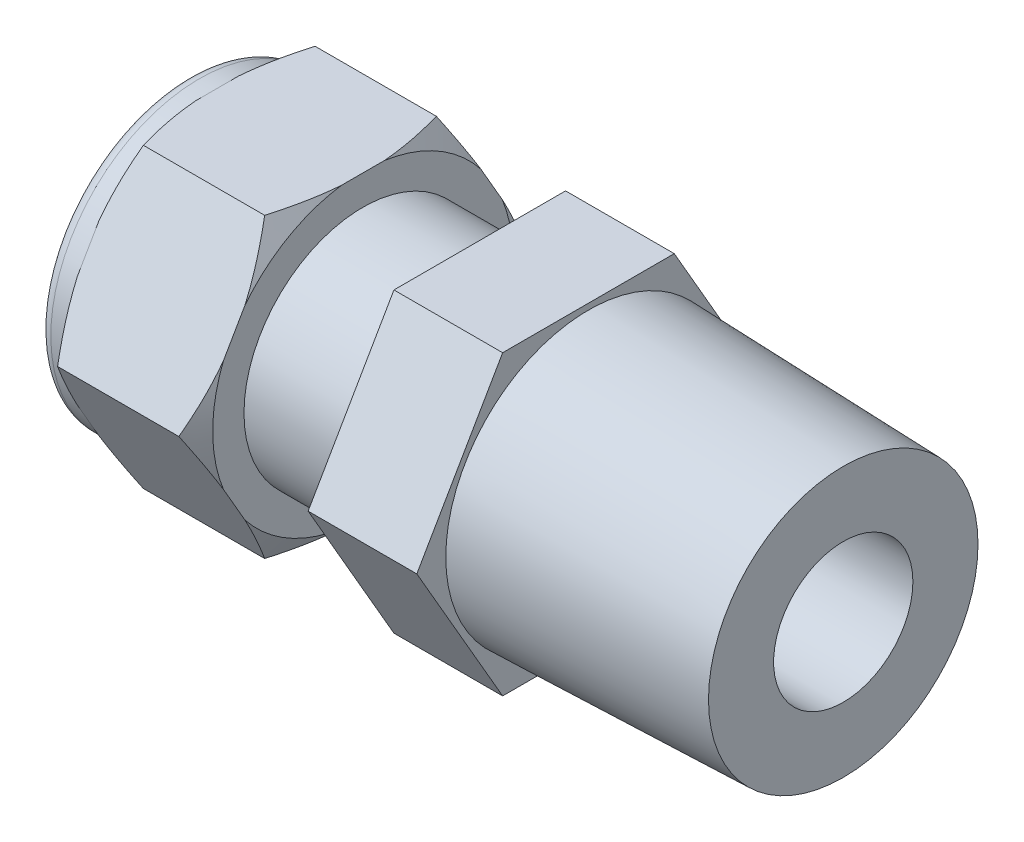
ISO-10303-21;
HEADER;
FILE_DESCRIPTION(('STEP AP214'),'2;1');
FILE_NAME('part.step','',(''),(''),'','','');
FILE_SCHEMA(('AUTOMOTIVE_DESIGN { 1 0 10303 214 1 1 1 1 }'));
ENDSEC;
DATA;
#1=APPLICATION_CONTEXT('core data for automotive mechanical design processes');
#2=APPLICATION_PROTOCOL_DEFINITION('international standard','automotive_design',2000,#1);
#3=PRODUCT_CONTEXT('',#1,'mechanical');
#4=PRODUCT('Part','Part','',(#3));
#5=PRODUCT_RELATED_PRODUCT_CATEGORY('part','',(#4));
#6=PRODUCT_DEFINITION_FORMATION('','',#4);
#7=PRODUCT_DEFINITION_CONTEXT('part definition',#1,'design');
#8=PRODUCT_DEFINITION('design','',#6,#7);
#9=PRODUCT_DEFINITION_SHAPE('','',#8);
#10=(LENGTH_UNIT() NAMED_UNIT(*) SI_UNIT(.MILLI.,.METRE.));
#11=(NAMED_UNIT(*) PLANE_ANGLE_UNIT() SI_UNIT($,.RADIAN.));
#12=(NAMED_UNIT(*) SI_UNIT($,.STERADIAN.) SOLID_ANGLE_UNIT());
#13=UNCERTAINTY_MEASURE_WITH_UNIT(LENGTH_MEASURE(1.E-05),#10,'distance_accuracy_value','');
#14=(GEOMETRIC_REPRESENTATION_CONTEXT(3) GLOBAL_UNCERTAINTY_ASSIGNED_CONTEXT((#13)) GLOBAL_UNIT_ASSIGNED_CONTEXT((#10,
#11,#12)) REPRESENTATION_CONTEXT('',''));
#15=CARTESIAN_POINT('',(0.,0.,0.));
#16=DIRECTION('',(0.,0.,1.));
#17=DIRECTION('',(1.,0.,0.));
#18=AXIS2_PLACEMENT_3D('',#15,#16,#17);
#19=CARTESIAN_POINT('',(-49.022,0.,0.));
#20=DIRECTION('',(1.,0.,0.));
#21=DIRECTION('',(0.,0.,-1.));
#22=AXIS2_PLACEMENT_3D('',#19,#20,#21);
#23=PLANE('',#22);
#24=CARTESIAN_POINT('',(-49.022,0.,0.));
#25=DIRECTION('',(1.,0.,0.));
#26=DIRECTION('',(0.,0.,-1.));
#27=AXIS2_PLACEMENT_3D('',#24,#25,#26);
#28=CIRCLE('',#27,10.2235);
#29=CARTESIAN_POINT('',(-49.022,0.,-10.2235));
#30=VERTEX_POINT('',#29);
#31=EDGE_CURVE('E290',#30,#30,#28,.F.);
#32=ORIENTED_EDGE('',*,*,#31,.T.);
#33=EDGE_LOOP('',(#32));
#34=FACE_BOUND('',#33,.T.);
#35=CARTESIAN_POINT('',(-49.022,0.,0.));
#36=DIRECTION('',(1.,0.,0.));
#37=DIRECTION('',(0.,0.,-1.));
#38=AXIS2_PLACEMENT_3D('',#35,#36,#37);
#39=CIRCLE('',#38,6.35);
#40=CARTESIAN_POINT('',(-49.022,0.,-6.35));
#41=VERTEX_POINT('',#40);
#42=EDGE_CURVE('E714',#41,#41,#39,.T.);
#43=ORIENTED_EDGE('',*,*,#42,.T.);
#44=EDGE_LOOP('',(#43));
#45=FACE_BOUND('',#44,.T.);
#46=ADVANCED_FACE('F32',(#34,#45),#23,.F.);
#47=CARTESIAN_POINT('',(-35.9156,-11.1125,-6.41580486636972));
#48=DIRECTION('',(0.,0.5,0.866025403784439));
#49=DIRECTION('',(0.,-0.866025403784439,0.5));
#50=AXIS2_PLACEMENT_3D('',#47,#48,#49);
#51=PLANE('',#50);
#52=CARTESIAN_POINT('',(-40.3644672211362,-18.831689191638,-1.95912890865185));
#53=CARTESIAN_POINT('',(-40.176043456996,-18.4825253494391,-2.16071874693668));
#54=CARTESIAN_POINT('',(-39.9896517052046,-18.1325262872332,-2.36279079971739));
#55=CARTESIAN_POINT('',(-39.6218864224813,-17.4305055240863,-2.76810267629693));
#56=CARTESIAN_POINT('',(-39.4405135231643,-17.0784835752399,-2.97134264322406));
#57=CARTESIAN_POINT('',(-39.0832157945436,-16.371019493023,-3.37979722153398));
#58=CARTESIAN_POINT('',(-38.9073103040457,-16.015570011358,-3.58501607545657));
#59=CARTESIAN_POINT('',(-38.5628685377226,-15.3020089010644,-3.99699077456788));
#60=CARTESIAN_POINT('',(-38.3943320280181,-14.9438973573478,-4.20374657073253));
#61=CARTESIAN_POINT('',(-38.0620665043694,-14.2154315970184,-4.62432647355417));
#62=CARTESIAN_POINT('',(-37.8985690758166,-13.8449977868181,-4.83819653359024));
#63=CARTESIAN_POINT('',(-37.5832139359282,-13.1003943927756,-5.26809350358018));
#64=CARTESIAN_POINT('',(-37.4313567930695,-12.7262246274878,-5.4841205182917));
#65=CARTESIAN_POINT('',(-37.1421713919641,-11.9740617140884,-5.91838197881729));
#66=CARTESIAN_POINT('',(-37.0048291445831,-11.5960726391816,-6.13661407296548));
#67=CARTESIAN_POINT('',(-36.7478424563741,-10.8356566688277,-6.57564043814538));
#68=CARTESIAN_POINT('',(-36.6281957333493,-10.4532303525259,-6.79643437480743));
#69=CARTESIAN_POINT('',(-36.3694010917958,-9.53870279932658,-7.3244371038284));
#70=CARTESIAN_POINT('',(-36.2398776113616,-9.00447137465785,-7.63287576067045));
#71=CARTESIAN_POINT('',(-36.0841701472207,-8.19765956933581,-8.09868877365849));
#72=CARTESIAN_POINT('',(-36.038698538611,-7.92782456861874,-8.25447808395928));
#73=CARTESIAN_POINT('',(-35.9617501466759,-7.38663974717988,-8.56693128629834));
#74=CARTESIAN_POINT('',(-35.9302732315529,-7.11528994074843,-8.72359517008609));
#75=CARTESIAN_POINT('',(-35.8825002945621,-6.57475546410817,-9.03567289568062));
#76=CARTESIAN_POINT('',(-35.8660321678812,-6.30558226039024,-9.1910801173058));
#77=CARTESIAN_POINT('',(-35.8481429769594,-5.76685974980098,-9.50211170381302));
#78=CARTESIAN_POINT('',(-35.8467217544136,-5.49731044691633,-9.65773606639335));
#79=CARTESIAN_POINT('',(-35.8589714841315,-4.95847234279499,-9.96883439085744));
#80=CARTESIAN_POINT('',(-35.872642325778,-4.68918353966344,-10.1243083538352));
#81=CARTESIAN_POINT('',(-35.9146623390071,-4.15143782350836,-10.4347759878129));
#82=CARTESIAN_POINT('',(-35.9430137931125,-3.88298104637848,-10.5897695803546));
#83=CARTESIAN_POINT('',(-36.0265867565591,-3.24897745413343,-10.9558117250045));
#84=CARTESIAN_POINT('',(-36.0878549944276,-2.88402385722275,-11.1665177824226));
#85=CARTESIAN_POINT('',(-36.2335162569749,-2.15760483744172,-11.5859159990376));
#86=CARTESIAN_POINT('',(-36.3179126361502,-1.79613992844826,-11.7946078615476));
#87=CARTESIAN_POINT('',(-36.506644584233,-1.07674438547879,-12.2099510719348));
#88=CARTESIAN_POINT('',(-36.6110026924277,-0.718818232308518,-12.4165998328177));
#89=CARTESIAN_POINT('',(-36.8363699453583,-0.00698201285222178,-12.8275786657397));
#90=CARTESIAN_POINT('',(-36.9573780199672,0.346928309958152,-13.0319088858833));
#91=CARTESIAN_POINT('',(-37.2146950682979,1.05517458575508,-13.4408150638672));
#92=CARTESIAN_POINT('',(-37.3511695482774,1.40946512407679,-13.6453648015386));
#93=CARTESIAN_POINT('',(-37.6355933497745,2.11429255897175,-14.0522971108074));
#94=CARTESIAN_POINT('',(-37.7835350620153,2.46483177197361,-14.2546810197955));
#95=CARTESIAN_POINT('',(-38.0888511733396,3.16269445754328,-14.6575922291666));
#96=CARTESIAN_POINT('',(-38.2462230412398,3.51001876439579,-14.858120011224));
#97=CARTESIAN_POINT('',(-38.56877442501,4.20198312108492,-15.2576258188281));
#98=CARTESIAN_POINT('',(-38.7339549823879,4.54662280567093,-15.4566036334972));
#99=CARTESIAN_POINT('',(-39.0195576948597,5.12910629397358,-15.7929006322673));
#100=CARTESIAN_POINT('',(-39.1383196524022,5.3675631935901,-15.930573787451));
#101=CARTESIAN_POINT('',(-39.3785868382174,5.84342856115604,-16.2053147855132));
#102=CARTESIAN_POINT('',(-39.5000919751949,6.08083706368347,-16.3423826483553));
#103=CARTESIAN_POINT('',(-39.7442226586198,6.552206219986,-16.6145277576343));
#104=CARTESIAN_POINT('',(-39.8668227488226,6.78617677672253,-16.7496107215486));
#105=CARTESIAN_POINT('',(-40.1141304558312,7.25328632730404,-17.0192965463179));
#106=CARTESIAN_POINT('',(-40.238838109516,7.4864253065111,-17.1538993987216));
#107=CARTESIAN_POINT('',(-40.3644672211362,7.71918919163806,-17.2882856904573));
#108=B_SPLINE_CURVE_WITH_KNOTS('',3,(#52,#53,#54,#55,#56,#57,#58,#59,#60,#61,#62,#63,#64,#65,
#66,#67,#68,#69,#70,#71,#72,#73,#74,#75,#76,#77,#78,#79,#80,#81,#82,#83,#84,#85,#86,#87,#88,#89,
#90,#91,#92,#93,#94,#95,#96,#97,#98,#99,#100,#101,#102,#103,#104,#105,#106,#107),.UNSPECIFIED.,
.F.,.F.,(4,2,2,2,2,2,2,2,2,2,2,2,2,2,2,2,2,2,2,2,2,2,2,2,2,2,2,4),(0.,1.33512337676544,
2.67041401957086,4.0099872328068,5.34951789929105,6.7231469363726,8.0968430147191,
9.46920284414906,10.8413855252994,12.730320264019,13.6746972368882,14.6190653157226,
15.5524629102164,16.4858506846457,17.4192316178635,18.3527577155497,19.6295133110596,
20.906454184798,22.1848454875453,23.463154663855,24.7567335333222,26.049461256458,
27.3418435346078,28.6343986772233,29.5339839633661,30.4335393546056,31.3235770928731,
32.2136304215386),.UNSPECIFIED.);
#109=CARTESIAN_POINT('',(-36.8416416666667,-11.1125,-6.41580486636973));
#110=VERTEX_POINT('',#109);
#111=CARTESIAN_POINT('',(-35.9156,-6.94531249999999,-8.82173169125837));
#112=VERTEX_POINT('',#111);
#113=EDGE_CURVE('E403',#110,#112,#108,.T.);
#114=ORIENTED_EDGE('',*,*,#113,.F.);
#115=DIRECTION('',(-1.,0.,0.));
#116=VECTOR('',#115,1.);
#117=CARTESIAN_POINT('',(-35.9156,-11.1125,-6.41580486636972));
#118=LINE('',#117,#116);
#119=CARTESIAN_POINT('',(-45.9115583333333,-11.1125,-6.41580486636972));
#120=VERTEX_POINT('',#119);
#121=EDGE_CURVE('E243',#110,#120,#118,.T.);
#122=ORIENTED_EDGE('',*,*,#121,.T.);
#123=CARTESIAN_POINT('',(-42.3887327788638,7.71918919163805,-17.2882856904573));
#124=CARTESIAN_POINT('',(-42.5771565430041,7.37002534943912,-17.0866958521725));
#125=CARTESIAN_POINT('',(-42.7635482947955,7.02002628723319,-16.8846237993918));
#126=CARTESIAN_POINT('',(-43.1313135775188,6.31800552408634,-16.4793119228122));
#127=CARTESIAN_POINT('',(-43.3126864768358,5.96598357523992,-16.2760719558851));
#128=CARTESIAN_POINT('',(-43.6699842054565,5.25851949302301,-15.8676173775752));
#129=CARTESIAN_POINT('',(-43.8458896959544,4.90307001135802,-15.6623985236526));
#130=CARTESIAN_POINT('',(-44.1903314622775,4.18950890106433,-15.2504238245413));
#131=CARTESIAN_POINT('',(-44.358867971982,3.83139735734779,-15.0436680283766));
#132=CARTESIAN_POINT('',(-44.6911334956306,3.10293159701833,-14.623088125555));
#133=CARTESIAN_POINT('',(-44.8546309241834,2.73249778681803,-14.4092180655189));
#134=CARTESIAN_POINT('',(-45.1699860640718,1.98789439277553,-13.9793210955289));
#135=CARTESIAN_POINT('',(-45.3218432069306,1.61372462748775,-13.7632940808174));
#136=CARTESIAN_POINT('',(-45.611028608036,0.861561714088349,-13.3290326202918));
#137=CARTESIAN_POINT('',(-45.748370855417,0.483572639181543,-13.1108005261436));
#138=CARTESIAN_POINT('',(-46.0053575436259,-0.276843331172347,-12.6717741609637));
#139=CARTESIAN_POINT('',(-46.1250042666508,-0.659269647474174,-12.4509802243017));
#140=CARTESIAN_POINT('',(-46.3837989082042,-1.57379720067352,-11.9229774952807));
#141=CARTESIAN_POINT('',(-46.5133223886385,-2.10802862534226,-11.6145388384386));
#142=CARTESIAN_POINT('',(-46.6690298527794,-2.91484043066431,-11.1487258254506));
#143=CARTESIAN_POINT('',(-46.714501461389,-3.18467543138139,-10.9929365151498));
#144=CARTESIAN_POINT('',(-46.7914498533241,-3.72586025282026,-10.6804833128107));
#145=CARTESIAN_POINT('',(-46.8229267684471,-3.99721005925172,-10.523819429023));
#146=CARTESIAN_POINT('',(-46.8706997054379,-4.53774453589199,-10.2117417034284));
#147=CARTESIAN_POINT('',(-46.8871678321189,-4.80691773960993,-10.0563344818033));
#148=CARTESIAN_POINT('',(-46.9050570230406,-5.3456402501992,-9.74530289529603));
#149=CARTESIAN_POINT('',(-46.9064782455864,-5.61518955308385,-9.5896785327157));
#150=CARTESIAN_POINT('',(-46.8942285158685,-6.1540276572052,-9.27858020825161));
#151=CARTESIAN_POINT('',(-46.8805576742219,-6.42331646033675,-9.12310624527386));
#152=CARTESIAN_POINT('',(-46.8385376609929,-6.96106217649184,-8.81263861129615));
#153=CARTESIAN_POINT('',(-46.8101862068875,-7.22951895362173,-8.65764501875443));
#154=CARTESIAN_POINT('',(-46.7266132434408,-7.8635225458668,-8.29160287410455));
#155=CARTESIAN_POINT('',(-46.6653450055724,-8.2284761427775,-8.08089681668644));
#156=CARTESIAN_POINT('',(-46.5196837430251,-8.95489516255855,-7.66149860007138));
#157=CARTESIAN_POINT('',(-46.4352873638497,-9.31636007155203,-7.45280673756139));
#158=CARTESIAN_POINT('',(-46.2465554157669,-10.0357556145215,-7.03746352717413));
#159=CARTESIAN_POINT('',(-46.1421973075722,-10.3936817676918,-6.83081476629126));
#160=CARTESIAN_POINT('',(-45.9168300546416,-11.1055179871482,-6.41983593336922));
#161=CARTESIAN_POINT('',(-45.7958219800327,-11.4594283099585,-6.21550571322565));
#162=CARTESIAN_POINT('',(-45.5385049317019,-12.1676745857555,-5.80659953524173));
#163=CARTESIAN_POINT('',(-45.4020304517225,-12.5219651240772,-5.60204979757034));
#164=CARTESIAN_POINT('',(-45.1176066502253,-13.2267925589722,-5.19511748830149));
#165=CARTESIAN_POINT('',(-44.9696649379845,-13.5773317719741,-4.99273357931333));
#166=CARTESIAN_POINT('',(-44.6643488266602,-14.2751944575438,-4.58982236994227));
#167=CARTESIAN_POINT('',(-44.50697695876,-14.6225187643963,-4.38929458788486));
#168=CARTESIAN_POINT('',(-44.1844255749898,-15.3144831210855,-3.98978878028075));
#169=CARTESIAN_POINT('',(-44.0192450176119,-15.6591228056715,-3.79081096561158));
#170=CARTESIAN_POINT('',(-43.73364230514,-16.2416062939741,-3.45451396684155));
#171=CARTESIAN_POINT('',(-43.6148803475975,-16.4800631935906,-3.31684081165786));
#172=CARTESIAN_POINT('',(-43.3746131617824,-16.9559285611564,-3.04209981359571));
#173=CARTESIAN_POINT('',(-43.2531080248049,-17.1933370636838,-2.90503195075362));
#174=CARTESIAN_POINT('',(-43.0089773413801,-17.6647062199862,-2.63288684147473));
#175=CARTESIAN_POINT('',(-42.8863772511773,-17.8986767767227,-2.49780387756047));
#176=CARTESIAN_POINT('',(-42.6390695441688,-18.3657863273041,-2.22811805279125));
#177=CARTESIAN_POINT('',(-42.514361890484,-18.5989253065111,-2.09351520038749));
#178=CARTESIAN_POINT('',(-42.3887327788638,-18.831689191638,-1.95912890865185));
#179=B_SPLINE_CURVE_WITH_KNOTS('',3,(#123,#124,#125,#126,#127,#128,#129,#130,#131,#132,#133,
#134,#135,#136,#137,#138,#139,#140,#141,#142,#143,#144,#145,#146,#147,#148,#149,#150,#151,#152,
#153,#154,#155,#156,#157,#158,#159,#160,#161,#162,#163,#164,#165,#166,#167,#168,#169,#170,#171,
#172,#173,#174,#175,#176,#177,#178),.UNSPECIFIED.,.F.,.F.,(4,2,2,2,2,2,2,2,2,2,2,2,2,2,2,2,2,2,
2,2,2,2,2,2,2,2,2,4),(0.,1.33512337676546,2.67041401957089,4.00998723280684,5.3495178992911,
6.72314693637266,8.09684301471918,9.46920284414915,10.8413855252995,12.7303202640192,
13.6746972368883,14.6190653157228,15.5524629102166,16.4858506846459,17.4192316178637,
18.3527577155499,19.6295133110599,20.9064541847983,22.1848454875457,23.4631546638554,
24.7567335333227,26.0494612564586,27.3418435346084,28.634398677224,29.5339839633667,
30.433539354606,31.3235770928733,32.2136304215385),.UNSPECIFIED.);
#180=CARTESIAN_POINT('',(-46.8376,-6.94531249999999,-8.82173169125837));
#181=VERTEX_POINT('',#180);
#182=EDGE_CURVE('E335',#181,#120,#179,.T.);
#183=ORIENTED_EDGE('',*,*,#182,.F.);
#184=DIRECTION('',(0.,0.866025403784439,-0.5));
#185=VECTOR('',#184,1.);
#186=CARTESIAN_POINT('',(-46.8376,-11.1125,-6.41580486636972));
#187=LINE('',#186,#185);
#188=CARTESIAN_POINT('',(-46.8376,-5.55625,-9.62370729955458));
#189=VERTEX_POINT('',#188);
#190=EDGE_CURVE('E244',#181,#189,#187,.T.);
#191=ORIENTED_EDGE('',*,*,#190,.T.);
#192=CARTESIAN_POINT('',(-46.8376,-4.16718750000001,-10.4256829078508));
#193=VERTEX_POINT('',#192);
#194=EDGE_CURVE('E247',#189,#193,#187,.T.);
#195=ORIENTED_EDGE('',*,*,#194,.T.);
#196=CARTESIAN_POINT('',(-45.9115583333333,0.,-12.8316097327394));
#197=VERTEX_POINT('',#196);
#198=EDGE_CURVE('E468',#197,#193,#179,.T.);
#199=ORIENTED_EDGE('',*,*,#198,.F.);
#200=DIRECTION('',(-1.,0.,0.));
#201=VECTOR('',#200,1.);
#202=CARTESIAN_POINT('',(-35.9156,0.,-12.8316097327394));
#203=LINE('',#202,#201);
#204=CARTESIAN_POINT('',(-36.8416416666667,0.,-12.8316097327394));
#205=VERTEX_POINT('',#204);
#206=EDGE_CURVE('E271',#205,#197,#203,.T.);
#207=ORIENTED_EDGE('',*,*,#206,.F.);
#208=CARTESIAN_POINT('',(-35.9156,-4.16718750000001,-10.4256829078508));
#209=VERTEX_POINT('',#208);
#210=EDGE_CURVE('E394',#209,#205,#108,.T.);
#211=ORIENTED_EDGE('',*,*,#210,.F.);
#212=DIRECTION('',(0.,0.866025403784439,-0.5));
#213=VECTOR('',#212,1.);
#214=CARTESIAN_POINT('',(-35.9156,-11.1125,-6.41580486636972));
#215=LINE('',#214,#213);
#216=EDGE_CURVE('E262',#112,#209,#215,.T.);
#217=ORIENTED_EDGE('',*,*,#216,.F.);
#218=EDGE_LOOP('',(#114,#122,#183,#191,#195,#199,#207,#211,#217));
#219=FACE_BOUND('',#218,.T.);
#220=ADVANCED_FACE('F521',(#219),#51,.F.);
#221=CARTESIAN_POINT('',(-35.9156,0.,-12.8316097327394));
#222=DIRECTION('',(0.,-0.5,0.866025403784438));
#223=DIRECTION('',(0.,-0.866025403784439,-0.5));
#224=AXIS2_PLACEMENT_3D('',#221,#222,#223);
#225=PLANE('',#224);
#226=CARTESIAN_POINT('',(-40.3644672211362,-7.71918919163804,-17.2882856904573));
#227=CARTESIAN_POINT('',(-40.176043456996,-7.37002534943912,-17.0866958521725));
#228=CARTESIAN_POINT('',(-39.9896517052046,-7.02002628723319,-16.8846237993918));
#229=CARTESIAN_POINT('',(-39.6218864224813,-6.31800552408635,-16.4793119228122));
#230=CARTESIAN_POINT('',(-39.4405135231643,-5.96598357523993,-16.2760719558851));
#231=CARTESIAN_POINT('',(-39.0832157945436,-5.25851949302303,-15.8676173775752));
#232=CARTESIAN_POINT('',(-38.9073103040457,-4.90307001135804,-15.6623985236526));
#233=CARTESIAN_POINT('',(-38.5628685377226,-4.18950890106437,-15.2504238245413));
#234=CARTESIAN_POINT('',(-38.3943320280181,-3.83139735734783,-15.0436680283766));
#235=CARTESIAN_POINT('',(-38.0620665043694,-3.10293159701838,-14.623088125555));
#236=CARTESIAN_POINT('',(-37.8985690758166,-2.73249778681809,-14.4092180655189));
#237=CARTESIAN_POINT('',(-37.5832139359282,-1.9878943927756,-13.979321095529));
#238=CARTESIAN_POINT('',(-37.4313567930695,-1.61372462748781,-13.7632940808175));
#239=CARTESIAN_POINT('',(-37.1421713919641,-0.861561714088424,-13.3290326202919));
#240=CARTESIAN_POINT('',(-37.0048291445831,-0.48357263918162,-13.1108005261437));
#241=CARTESIAN_POINT('',(-36.7478424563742,0.276843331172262,-12.6717741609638));
#242=CARTESIAN_POINT('',(-36.6281957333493,0.659269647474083,-12.4509802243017));
#243=CARTESIAN_POINT('',(-36.3694010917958,1.57379720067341,-11.9229774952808));
#244=CARTESIAN_POINT('',(-36.2398776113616,2.10802862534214,-11.6145388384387));
#245=CARTESIAN_POINT('',(-36.0841701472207,2.91484043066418,-11.1487258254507));
#246=CARTESIAN_POINT('',(-36.038698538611,3.18467543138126,-10.9929365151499));
#247=CARTESIAN_POINT('',(-35.9617501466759,3.72586025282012,-10.6804833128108));
#248=CARTESIAN_POINT('',(-35.9302732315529,3.99721005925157,-10.5238194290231));
#249=CARTESIAN_POINT('',(-35.8825002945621,4.53774453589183,-10.2117417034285));
#250=CARTESIAN_POINT('',(-35.8660321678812,4.80691773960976,-10.0563344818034));
#251=CARTESIAN_POINT('',(-35.8481429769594,5.34564025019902,-9.74530289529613));
#252=CARTESIAN_POINT('',(-35.8467217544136,5.61518955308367,-9.5896785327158));
#253=CARTESIAN_POINT('',(-35.8589714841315,6.15402765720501,-9.27858020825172));
#254=CARTESIAN_POINT('',(-35.872642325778,6.42331646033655,-9.12310624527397));
#255=CARTESIAN_POINT('',(-35.9146623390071,6.96106217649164,-8.81263861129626));
#256=CARTESIAN_POINT('',(-35.9430137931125,7.22951895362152,-8.65764501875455));
#257=CARTESIAN_POINT('',(-36.0265867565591,7.86352254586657,-8.29160287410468));
#258=CARTESIAN_POINT('',(-36.0878549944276,8.22847614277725,-8.08089681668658));
#259=CARTESIAN_POINT('',(-36.2335162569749,8.95489516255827,-7.66149860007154));
#260=CARTESIAN_POINT('',(-36.3179126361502,9.31636007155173,-7.45280673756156));
#261=CARTESIAN_POINT('',(-36.506644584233,10.0357556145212,-7.03746352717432));
#262=CARTESIAN_POINT('',(-36.6110026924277,10.3936817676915,-6.83081476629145));
#263=CARTESIAN_POINT('',(-36.8363699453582,11.1055179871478,-6.41983593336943));
#264=CARTESIAN_POINT('',(-36.9573780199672,11.4594283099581,-6.21550571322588));
#265=CARTESIAN_POINT('',(-37.2146950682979,12.1676745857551,-5.80659953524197));
#266=CARTESIAN_POINT('',(-37.3511695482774,12.5219651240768,-5.60204979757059));
#267=CARTESIAN_POINT('',(-37.6355933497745,13.2267925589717,-5.19511748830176));
#268=CARTESIAN_POINT('',(-37.7835350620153,13.5773317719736,-4.99273357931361));
#269=CARTESIAN_POINT('',(-38.0888511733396,14.2751944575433,-4.58982236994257));
#270=CARTESIAN_POINT('',(-38.2462230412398,14.6225187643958,-4.38929458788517));
#271=CARTESIAN_POINT('',(-38.56877442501,15.3144831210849,-3.98978878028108));
#272=CARTESIAN_POINT('',(-38.7339549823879,15.6591228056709,-3.79081096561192));
#273=CARTESIAN_POINT('',(-39.0195576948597,16.2416062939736,-3.45451396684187));
#274=CARTESIAN_POINT('',(-39.1383196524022,16.4800631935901,-3.31684081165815));
#275=CARTESIAN_POINT('',(-39.3785868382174,16.955928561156,-3.04209981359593));
#276=CARTESIAN_POINT('',(-39.5000919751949,17.1933370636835,-2.90503195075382));
#277=CARTESIAN_POINT('',(-39.7442226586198,17.664706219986,-2.63288684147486));
#278=CARTESIAN_POINT('',(-39.8668227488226,17.8986767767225,-2.49780387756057));
#279=CARTESIAN_POINT('',(-40.1141304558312,18.365786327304,-2.22811805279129));
#280=CARTESIAN_POINT('',(-40.238838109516,18.5989253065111,-2.0935152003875));
#281=CARTESIAN_POINT('',(-40.3644672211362,18.8316891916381,-1.95912890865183));
#282=B_SPLINE_CURVE_WITH_KNOTS('',3,(#226,#227,#228,#229,#230,#231,#232,#233,#234,#235,#236,
#237,#238,#239,#240,#241,#242,#243,#244,#245,#246,#247,#248,#249,#250,#251,#252,#253,#254,#255,
#256,#257,#258,#259,#260,#261,#262,#263,#264,#265,#266,#267,#268,#269,#270,#271,#272,#273,#274,
#275,#276,#277,#278,#279,#280,#281),.UNSPECIFIED.,.F.,.F.,(4,2,2,2,2,2,2,2,2,2,2,2,2,2,2,2,2,2,
2,2,2,2,2,2,2,2,2,4),(0.,1.33512337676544,2.67041401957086,4.0099872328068,5.34951789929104,
6.7231469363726,8.0968430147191,9.46920284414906,10.8413855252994,12.730320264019,
13.6746972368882,14.6190653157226,15.5524629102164,16.4858506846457,17.4192316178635,
18.3527577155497,19.6295133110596,20.906454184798,22.1848454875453,23.463154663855,
24.7567335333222,26.049461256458,27.3418435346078,28.6343986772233,29.5339839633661,
30.4335393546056,31.3235770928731,32.2136304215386),.UNSPECIFIED.);
#283=CARTESIAN_POINT('',(-35.9156,4.16718750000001,-10.4256829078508));
#284=VERTEX_POINT('',#283);
#285=EDGE_CURVE('E390',#205,#284,#282,.T.);
#286=ORIENTED_EDGE('',*,*,#285,.F.);
#287=ORIENTED_EDGE('',*,*,#206,.T.);
#288=CARTESIAN_POINT('',(-42.3887327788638,18.831689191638,-1.95912890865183));
#289=CARTESIAN_POINT('',(-42.5771565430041,18.4825253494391,-2.16071874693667));
#290=CARTESIAN_POINT('',(-42.7635482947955,18.1325262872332,-2.36279079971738));
#291=CARTESIAN_POINT('',(-43.1313135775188,17.4305055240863,-2.76810267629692));
#292=CARTESIAN_POINT('',(-43.3126864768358,17.0784835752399,-2.97134264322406));
#293=CARTESIAN_POINT('',(-43.6699842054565,16.371019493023,-3.37979722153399));
#294=CARTESIAN_POINT('',(-43.8458896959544,16.015570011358,-3.58501607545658));
#295=CARTESIAN_POINT('',(-44.1903314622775,15.3020089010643,-3.99699077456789));
#296=CARTESIAN_POINT('',(-44.358867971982,14.9438973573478,-4.20374657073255));
#297=CARTESIAN_POINT('',(-44.6911334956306,14.2154315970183,-4.62432647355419));
#298=CARTESIAN_POINT('',(-44.8546309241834,13.844997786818,-4.83819653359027));
#299=CARTESIAN_POINT('',(-45.1699860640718,13.1003943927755,-5.26809350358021));
#300=CARTESIAN_POINT('',(-45.3218432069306,12.7262246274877,-5.48412051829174));
#301=CARTESIAN_POINT('',(-45.611028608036,11.9740617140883,-5.91838197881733));
#302=CARTESIAN_POINT('',(-45.748370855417,11.5960726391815,-6.13661407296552));
#303=CARTESIAN_POINT('',(-46.0053575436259,10.8356566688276,-6.57564043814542));
#304=CARTESIAN_POINT('',(-46.1250042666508,10.4532303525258,-6.79643437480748));
#305=CARTESIAN_POINT('',(-46.3837989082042,9.53870279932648,-7.32443710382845));
#306=CARTESIAN_POINT('',(-46.5133223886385,9.00447137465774,-7.63287576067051));
#307=CARTESIAN_POINT('',(-46.6690298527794,8.19765956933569,-8.09868877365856));
#308=CARTESIAN_POINT('',(-46.714501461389,7.92782456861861,-8.25447808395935));
#309=CARTESIAN_POINT('',(-46.7914498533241,7.38663974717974,-8.56693128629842));
#310=CARTESIAN_POINT('',(-46.8229267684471,7.11528994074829,-8.72359517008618));
#311=CARTESIAN_POINT('',(-46.8706997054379,6.57475546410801,-9.03567289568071));
#312=CARTESIAN_POINT('',(-46.8871678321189,6.30558226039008,-9.19108011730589));
#313=CARTESIAN_POINT('',(-46.9050570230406,5.7668597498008,-9.50211170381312));
#314=CARTESIAN_POINT('',(-46.9064782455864,5.49731044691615,-9.65773606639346));
#315=CARTESIAN_POINT('',(-46.8942285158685,4.9584723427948,-9.96883439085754));
#316=CARTESIAN_POINT('',(-46.8805576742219,4.68918353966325,-10.1243083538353));
#317=CARTESIAN_POINT('',(-46.8385376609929,4.15143782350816,-10.434775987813));
#318=CARTESIAN_POINT('',(-46.8101862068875,3.88298104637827,-10.5897695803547));
#319=CARTESIAN_POINT('',(-46.7266132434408,3.2489774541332,-10.9558117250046));
#320=CARTESIAN_POINT('',(-46.6653450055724,2.88402385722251,-11.1665177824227));
#321=CARTESIAN_POINT('',(-46.5196837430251,2.15760483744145,-11.5859159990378));
#322=CARTESIAN_POINT('',(-46.4352873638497,1.79613992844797,-11.7946078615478));
#323=CARTESIAN_POINT('',(-46.2465554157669,1.07674438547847,-12.209951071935));
#324=CARTESIAN_POINT('',(-46.1421973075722,0.718818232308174,-12.4165998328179));
#325=CARTESIAN_POINT('',(-45.9168300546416,0.00698201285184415,-12.8275786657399));
#326=CARTESIAN_POINT('',(-45.7958219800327,-0.346928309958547,-13.0319088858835));
#327=CARTESIAN_POINT('',(-45.5385049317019,-1.05517458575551,-13.4408150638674));
#328=CARTESIAN_POINT('',(-45.4020304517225,-1.40946512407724,-13.6453648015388));
#329=CARTESIAN_POINT('',(-45.1176066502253,-2.11429255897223,-14.0522971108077));
#330=CARTESIAN_POINT('',(-44.9696649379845,-2.46483177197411,-14.2546810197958));
#331=CARTESIAN_POINT('',(-44.6643488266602,-3.1626944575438,-14.6575922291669));
#332=CARTESIAN_POINT('',(-44.50697695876,-3.51001876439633,-14.8581200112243));
#333=CARTESIAN_POINT('',(-44.1844255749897,-4.20198312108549,-15.2576258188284));
#334=CARTESIAN_POINT('',(-44.0192450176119,-4.54662280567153,-15.4566036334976));
#335=CARTESIAN_POINT('',(-43.73364230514,-5.12910629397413,-15.7929006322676));
#336=CARTESIAN_POINT('',(-43.6148803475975,-5.3675631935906,-15.9305737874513));
#337=CARTESIAN_POINT('',(-43.3746131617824,-5.84342856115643,-16.2053147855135));
#338=CARTESIAN_POINT('',(-43.2531080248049,-6.08083706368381,-16.3423826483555));
#339=CARTESIAN_POINT('',(-43.0089773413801,-6.55220621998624,-16.6145277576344));
#340=CARTESIAN_POINT('',(-42.8863772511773,-6.78617677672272,-16.7496107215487));
#341=CARTESIAN_POINT('',(-42.6390695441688,-7.25328632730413,-17.0192965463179));
#342=CARTESIAN_POINT('',(-42.514361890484,-7.48642530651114,-17.1538993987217));
#343=CARTESIAN_POINT('',(-42.3887327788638,-7.71918919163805,-17.2882856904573));
#344=B_SPLINE_CURVE_WITH_KNOTS('',3,(#288,#289,#290,#291,#292,#293,#294,#295,#296,#297,#298,
#299,#300,#301,#302,#303,#304,#305,#306,#307,#308,#309,#310,#311,#312,#313,#314,#315,#316,#317,
#318,#319,#320,#321,#322,#323,#324,#325,#326,#327,#328,#329,#330,#331,#332,#333,#334,#335,#336,
#337,#338,#339,#340,#341,#342,#343),.UNSPECIFIED.,.F.,.F.,(4,2,2,2,2,2,2,2,2,2,2,2,2,2,2,2,2,2,
2,2,2,2,2,2,2,2,2,4),(0.,1.33512337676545,2.67041401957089,4.00998723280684,5.3495178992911,
6.72314693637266,8.09684301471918,9.46920284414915,10.8413855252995,12.7303202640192,
13.6746972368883,14.6190653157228,15.5524629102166,16.4858506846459,17.4192316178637,
18.3527577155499,19.6295133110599,20.9064541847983,22.1848454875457,23.4631546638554,
24.7567335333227,26.0494612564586,27.3418435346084,28.634398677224,29.5339839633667,
30.433539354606,31.3235770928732,32.2136304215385),.UNSPECIFIED.);
#345=CARTESIAN_POINT('',(-46.8376,4.16718750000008,-10.4256829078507));
#346=VERTEX_POINT('',#345);
#347=EDGE_CURVE('E466',#346,#197,#344,.T.);
#348=ORIENTED_EDGE('',*,*,#347,.F.);
#349=DIRECTION('',(0.,0.866025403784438,0.5));
#350=VECTOR('',#349,1.);
#351=CARTESIAN_POINT('',(-46.8376,0.,-12.8316097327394));
#352=LINE('',#351,#350);
#353=CARTESIAN_POINT('',(-46.8376,5.55625000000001,-9.62370729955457));
#354=VERTEX_POINT('',#353);
#355=EDGE_CURVE('E248',#346,#354,#352,.T.);
#356=ORIENTED_EDGE('',*,*,#355,.T.);
#357=CARTESIAN_POINT('',(-46.8376,6.9453125,-8.82173169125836));
#358=VERTEX_POINT('',#357);
#359=EDGE_CURVE('E246',#354,#358,#352,.T.);
#360=ORIENTED_EDGE('',*,*,#359,.T.);
#361=CARTESIAN_POINT('',(-45.9115583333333,11.1125,-6.41580486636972));
#362=VERTEX_POINT('',#361);
#363=EDGE_CURVE('E357',#362,#358,#344,.T.);
#364=ORIENTED_EDGE('',*,*,#363,.F.);
#365=DIRECTION('',(-1.,0.,0.));
#366=VECTOR('',#365,1.);
#367=CARTESIAN_POINT('',(-35.9156,11.1125,-6.41580486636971));
#368=LINE('',#367,#366);
#369=CARTESIAN_POINT('',(-36.8416416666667,11.1125,-6.41580486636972));
#370=VERTEX_POINT('',#369);
#371=EDGE_CURVE('E269',#370,#362,#368,.T.);
#372=ORIENTED_EDGE('',*,*,#371,.F.);
#373=CARTESIAN_POINT('',(-35.9156,6.9453125,-8.82173169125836));
#374=VERTEX_POINT('',#373);
#375=EDGE_CURVE('E385',#374,#370,#282,.T.);
#376=ORIENTED_EDGE('',*,*,#375,.F.);
#377=DIRECTION('',(0.,0.866025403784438,0.5));
#378=VECTOR('',#377,1.);
#379=CARTESIAN_POINT('',(-35.9156,0.,-12.8316097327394));
#380=LINE('',#379,#378);
#381=EDGE_CURVE('E237',#284,#374,#380,.T.);
#382=ORIENTED_EDGE('',*,*,#381,.F.);
#383=EDGE_LOOP('',(#286,#287,#348,#356,#360,#364,#372,#376,#382));
#384=FACE_BOUND('',#383,.T.);
#385=ADVANCED_FACE('F367',(#384),#225,.F.);
#386=CARTESIAN_POINT('',(-35.9156,11.1125,-6.41580486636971));
#387=DIRECTION('',(0.,-1.,0.));
#388=DIRECTION('',(0.,0.,-1.));
#389=AXIS2_PLACEMENT_3D('',#386,#387,#388);
#390=PLANE('',#389);
#391=CARTESIAN_POINT('',(-39.8141514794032,11.1125,-14.1349940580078));
#392=CARTESIAN_POINT('',(-39.6319745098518,11.1125,-13.7335106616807));
#393=CARTESIAN_POINT('',(-39.4521709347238,11.1125,-13.3309294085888));
#394=CARTESIAN_POINT('',(-39.0984621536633,11.1125,-12.523100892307));
#395=CARTESIAN_POINT('',(-38.9245580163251,11.1125,-12.1178531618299));
#396=CARTESIAN_POINT('',(-38.5831551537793,11.1125,-11.3026679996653));
#397=CARTESIAN_POINT('',(-38.4156861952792,11.1125,-10.8927180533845));
#398=CARTESIAN_POINT('',(-38.0895157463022,11.1125,-10.0693535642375));
#399=CARTESIAN_POINT('',(-37.9308138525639,11.1125,-9.65593918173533));
#400=CARTESIAN_POINT('',(-37.6248132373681,11.1125,-8.82698763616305));
#401=CARTESIAN_POINT('',(-37.4774667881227,11.1125,-8.41146817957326));
#402=CARTESIAN_POINT('',(-37.1957876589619,11.1125,-7.57598842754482));
#403=CARTESIAN_POINT('',(-37.0614556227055,11.1125,-7.15602791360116));
#404=CARTESIAN_POINT('',(-36.8088799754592,11.1125,-6.31186429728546));
#405=CARTESIAN_POINT('',(-36.6906153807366,11.1125,-5.8876675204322));
#406=CARTESIAN_POINT('',(-36.4733369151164,11.1125,-5.03436495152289));
#407=CARTESIAN_POINT('',(-36.3743203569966,11.1125,-4.60525985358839));
#408=CARTESIAN_POINT('',(-36.2239478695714,11.1125,-3.86452260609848));
#409=CARTESIAN_POINT('',(-36.1670345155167,11.1125,-3.55401813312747));
#410=CARTESIAN_POINT('',(-36.0662647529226,11.1125,-2.93088636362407));
#411=CARTESIAN_POINT('',(-36.0224079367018,11.1125,-2.61825913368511));
#412=CARTESIAN_POINT('',(-35.9489105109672,11.1125,-1.99140478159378));
#413=CARTESIAN_POINT('',(-35.9192663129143,11.1125,-1.67717808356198));
#414=CARTESIAN_POINT('',(-35.8750383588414,11.1125,-1.04765704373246));
#415=CARTESIAN_POINT('',(-35.8604545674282,11.1125,-0.732362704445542));
#416=CARTESIAN_POINT('',(-35.8468022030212,11.1125,-0.101597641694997));
#417=CARTESIAN_POINT('',(-35.8477256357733,11.1125,0.213872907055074));
#418=CARTESIAN_POINT('',(-35.8650387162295,11.1125,0.844383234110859));
#419=CARTESIAN_POINT('',(-35.8814282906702,11.1125,1.15942301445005));
#420=CARTESIAN_POINT('',(-35.9291731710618,11.1125,1.78839010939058));
#421=CARTESIAN_POINT('',(-35.9605300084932,11.1125,2.10231730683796));
#422=CARTESIAN_POINT('',(-36.0373067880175,11.1125,2.72843846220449));
#423=CARTESIAN_POINT('',(-36.0827273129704,11.1125,3.04063234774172));
#424=CARTESIAN_POINT('',(-36.2124269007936,11.1125,3.81855070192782));
#425=CARTESIAN_POINT('',(-36.3047777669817,11.1125,4.28293564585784));
#426=CARTESIAN_POINT('',(-36.5140558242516,11.1125,5.20613419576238));
#427=CARTESIAN_POINT('',(-36.6309884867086,11.1125,5.66494653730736));
#428=CARTESIAN_POINT('',(-36.8852945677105,11.1125,6.57791063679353));
#429=CARTESIAN_POINT('',(-37.0227126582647,11.1125,7.03204983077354));
#430=CARTESIAN_POINT('',(-37.3139006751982,11.1125,7.93497277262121));
#431=CARTESIAN_POINT('',(-37.4676694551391,11.1125,8.38375689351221));
#432=CARTESIAN_POINT('',(-37.7901934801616,11.1125,9.28169678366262));
#433=CARTESIAN_POINT('',(-37.9591004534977,11.1125,9.73079771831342));
#434=CARTESIAN_POINT('',(-38.3077163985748,11.1125,10.6247979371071));
#435=CARTESIAN_POINT('',(-38.4874260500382,11.1125,11.069696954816));
#436=CARTESIAN_POINT('',(-38.8544023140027,11.1125,11.9531117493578));
#437=CARTESIAN_POINT('',(-39.0416149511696,11.1125,12.3916500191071));
#438=CARTESIAN_POINT('',(-39.3276544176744,11.1125,13.04710685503));
#439=CARTESIAN_POINT('',(-39.423859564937,11.1125,13.2651756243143));
#440=CARTESIAN_POINT('',(-39.6178556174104,11.1125,13.7006022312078));
#441=CARTESIAN_POINT('',(-39.7156464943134,11.1125,13.9179600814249));
#442=CARTESIAN_POINT('',(-39.8141514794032,11.1125,14.1349940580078));
#443=B_SPLINE_CURVE_WITH_KNOTS('',3,(#391,#392,#393,#394,#395,#396,#397,#398,#399,#400,#401,
#402,#403,#404,#405,#406,#407,#408,#409,#410,#411,#412,#413,#414,#415,#416,#417,#418,#419,#420,
#421,#422,#423,#424,#425,#426,#427,#428,#429,#430,#431,#432,#433,#434,#435,#436,#437,#438,#439,
#440,#441,#442),.UNSPECIFIED.,.F.,.F.,(4,2,2,2,2,2,2,2,2,2,2,2,2,2,2,2,2,2,2,2,2,2,2,2,2,4),(0.,
1.32266815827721,2.64557463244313,3.97400303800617,5.30237028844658,6.62480949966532,
7.94731408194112,9.26807454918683,10.5886504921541,11.5354410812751,12.4822021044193,
13.4287239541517,14.3752435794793,15.3212752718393,16.2673024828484,17.2134265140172,
18.1595897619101,19.5791704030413,20.9990673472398,22.4221071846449,23.8450473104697,
25.2843164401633,26.7236762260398,28.1540804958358,28.8691172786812,29.5841413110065),.UNSPECIFIED.);
#444=CARTESIAN_POINT('',(-35.9156,11.1125,-1.60395121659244));
#445=VERTEX_POINT('',#444);
#446=EDGE_CURVE('E379',#370,#445,#443,.T.);
#447=ORIENTED_EDGE('',*,*,#446,.F.);
#448=ORIENTED_EDGE('',*,*,#371,.T.);
#449=CARTESIAN_POINT('',(-42.9390485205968,11.1125,14.1349940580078));
#450=CARTESIAN_POINT('',(-43.1212254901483,11.1125,13.7335106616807));
#451=CARTESIAN_POINT('',(-43.3010290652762,11.1125,13.3309294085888));
#452=CARTESIAN_POINT('',(-43.6547378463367,11.1125,12.523100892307));
#453=CARTESIAN_POINT('',(-43.8286419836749,11.1125,12.1178531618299));
#454=CARTESIAN_POINT('',(-44.1700448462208,11.1125,11.3026679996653));
#455=CARTESIAN_POINT('',(-44.3375138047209,11.1125,10.8927180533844));
#456=CARTESIAN_POINT('',(-44.6636842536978,11.1125,10.0693535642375));
#457=CARTESIAN_POINT('',(-44.8223861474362,11.1125,9.65593918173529));
#458=CARTESIAN_POINT('',(-45.1283867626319,11.1125,8.826987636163));
#459=CARTESIAN_POINT('',(-45.2757332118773,11.1125,8.41146817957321));
#460=CARTESIAN_POINT('',(-45.5574123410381,11.1125,7.57598842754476));
#461=CARTESIAN_POINT('',(-45.6917443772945,11.1125,7.15602791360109));
#462=CARTESIAN_POINT('',(-45.9443200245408,11.1125,6.31186429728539));
#463=CARTESIAN_POINT('',(-46.0625846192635,11.1125,5.88766752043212));
#464=CARTESIAN_POINT('',(-46.2798630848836,11.1125,5.03436495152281));
#465=CARTESIAN_POINT('',(-46.3788796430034,11.1125,4.60525985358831));
#466=CARTESIAN_POINT('',(-46.5292521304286,11.1125,3.86452260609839));
#467=CARTESIAN_POINT('',(-46.5861654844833,11.1125,3.55401813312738));
#468=CARTESIAN_POINT('',(-46.6869352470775,11.1125,2.93088636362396));
#469=CARTESIAN_POINT('',(-46.7307920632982,11.1125,2.618259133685));
#470=CARTESIAN_POINT('',(-46.8042894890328,11.1125,1.99140478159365));
#471=CARTESIAN_POINT('',(-46.8339336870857,11.1125,1.67717808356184));
#472=CARTESIAN_POINT('',(-46.8781616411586,11.1125,1.04765704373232));
#473=CARTESIAN_POINT('',(-46.8927454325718,11.1125,0.732362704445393));
#474=CARTESIAN_POINT('',(-46.9063977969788,11.1125,0.101597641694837));
#475=CARTESIAN_POINT('',(-46.9054743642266,11.1125,-0.21387290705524));
#476=CARTESIAN_POINT('',(-46.8881612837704,11.1125,-0.844383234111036));
#477=CARTESIAN_POINT('',(-46.8717717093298,11.1125,-1.15942301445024));
#478=CARTESIAN_POINT('',(-46.8240268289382,11.1125,-1.78839010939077));
#479=CARTESIAN_POINT('',(-46.7926699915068,11.1125,-2.10231730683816));
#480=CARTESIAN_POINT('',(-46.7158932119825,11.1125,-2.7284384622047));
#481=CARTESIAN_POINT('',(-46.6704726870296,11.1125,-3.04063234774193));
#482=CARTESIAN_POINT('',(-46.5407730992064,11.1125,-3.81855070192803));
#483=CARTESIAN_POINT('',(-46.4484222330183,11.1125,-4.28293564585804));
#484=CARTESIAN_POINT('',(-46.2391441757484,11.1125,-5.20613419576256));
#485=CARTESIAN_POINT('',(-46.1222115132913,11.1125,-5.66494653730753));
#486=CARTESIAN_POINT('',(-45.8679054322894,11.1125,-6.57791063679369));
#487=CARTESIAN_POINT('',(-45.7304873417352,11.1125,-7.03204983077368));
#488=CARTESIAN_POINT('',(-45.4392993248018,11.1125,-7.93497277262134));
#489=CARTESIAN_POINT('',(-45.2855305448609,11.1125,-8.38375689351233));
#490=CARTESIAN_POINT('',(-44.9630065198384,11.1125,-9.28169678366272));
#491=CARTESIAN_POINT('',(-44.7940995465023,11.1125,-9.73079771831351));
#492=CARTESIAN_POINT('',(-44.4454836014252,11.1125,-10.6247979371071));
#493=CARTESIAN_POINT('',(-44.2657739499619,11.1125,-11.0696969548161));
#494=CARTESIAN_POINT('',(-43.8987976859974,11.1125,-11.9531117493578));
#495=CARTESIAN_POINT('',(-43.7115850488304,11.1125,-12.3916500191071));
#496=CARTESIAN_POINT('',(-43.4255455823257,11.1125,-13.04710685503));
#497=CARTESIAN_POINT('',(-43.329340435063,11.1125,-13.2651756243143));
#498=CARTESIAN_POINT('',(-43.1353443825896,11.1125,-13.7006022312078));
#499=CARTESIAN_POINT('',(-43.0375535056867,11.1125,-13.9179600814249));
#500=CARTESIAN_POINT('',(-42.9390485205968,11.1125,-14.1349940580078));
#501=B_SPLINE_CURVE_WITH_KNOTS('',3,(#449,#450,#451,#452,#453,#454,#455,#456,#457,#458,#459,
#460,#461,#462,#463,#464,#465,#466,#467,#468,#469,#470,#471,#472,#473,#474,#475,#476,#477,#478,
#479,#480,#481,#482,#483,#484,#485,#486,#487,#488,#489,#490,#491,#492,#493,#494,#495,#496,#497,
#498,#499,#500),.UNSPECIFIED.,.F.,.F.,(4,2,2,2,2,2,2,2,2,2,2,2,2,2,2,2,2,2,2,2,2,2,2,2,2,4),(0.,
1.32266815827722,2.64557463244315,3.9740030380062,5.30237028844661,6.62480949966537,
7.94731408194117,9.26807454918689,10.5886504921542,11.5354410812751,12.4822021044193,
13.4287239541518,14.3752435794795,15.3212752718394,16.2673024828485,17.2134265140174,
18.1595897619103,19.5791704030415,20.9990673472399,22.422107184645,23.8450473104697,
25.2843164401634,26.7236762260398,28.1540804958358,28.8691172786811,29.5841413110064),.UNSPECIFIED.);
#502=CARTESIAN_POINT('',(-46.8376,11.1125,-1.60395121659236));
#503=VERTEX_POINT('',#502);
#504=EDGE_CURVE('E355',#503,#362,#501,.T.);
#505=ORIENTED_EDGE('',*,*,#504,.F.);
#506=DIRECTION('',(0.,0.,1.));
#507=VECTOR('',#506,1.);
#508=CARTESIAN_POINT('',(-46.8376,11.1125,-6.41580486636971));
#509=LINE('',#508,#507);
#510=CARTESIAN_POINT('',(-46.8376,11.1125,0.));
#511=VERTEX_POINT('',#510);
#512=EDGE_CURVE('E251',#503,#511,#509,.T.);
#513=ORIENTED_EDGE('',*,*,#512,.T.);
#514=CARTESIAN_POINT('',(-46.8376,11.1125,1.60395121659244));
#515=VERTEX_POINT('',#514);
#516=EDGE_CURVE('E250',#511,#515,#509,.T.);
#517=ORIENTED_EDGE('',*,*,#516,.T.);
#518=CARTESIAN_POINT('',(-45.9115583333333,11.1125,6.41580486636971));
#519=VERTEX_POINT('',#518);
#520=EDGE_CURVE('E349',#519,#515,#501,.T.);
#521=ORIENTED_EDGE('',*,*,#520,.F.);
#522=DIRECTION('',(-1.,0.,0.));
#523=VECTOR('',#522,1.);
#524=CARTESIAN_POINT('',(-35.9156,11.1125,6.41580486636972));
#525=LINE('',#524,#523);
#526=CARTESIAN_POINT('',(-36.8416416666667,11.1125,6.41580486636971));
#527=VERTEX_POINT('',#526);
#528=EDGE_CURVE('E267',#527,#519,#525,.T.);
#529=ORIENTED_EDGE('',*,*,#528,.F.);
#530=CARTESIAN_POINT('',(-35.9156,11.1125,1.60395121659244));
#531=VERTEX_POINT('',#530);
#532=EDGE_CURVE('E373',#531,#527,#443,.T.);
#533=ORIENTED_EDGE('',*,*,#532,.F.);
#534=DIRECTION('',(0.,0.,1.));
#535=VECTOR('',#534,1.);
#536=CARTESIAN_POINT('',(-35.9156,11.1125,-6.41580486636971));
#537=LINE('',#536,#535);
#538=EDGE_CURVE('E233',#445,#531,#537,.T.);
#539=ORIENTED_EDGE('',*,*,#538,.F.);
#540=EDGE_LOOP('',(#447,#448,#505,#513,#517,#521,#529,#533,#539));
#541=FACE_BOUND('',#540,.T.);
#542=ADVANCED_FACE('F364',(#541),#390,.F.);
#543=CARTESIAN_POINT('',(-35.9156,11.1125,6.41580486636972));
#544=DIRECTION('',(0.,-0.5,-0.866025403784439));
#545=DIRECTION('',(0.,0.866025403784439,-0.5));
#546=AXIS2_PLACEMENT_3D('',#543,#544,#545);
#547=PLANE('',#546);
#548=CARTESIAN_POINT('',(-40.3644672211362,18.831689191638,1.95912890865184));
#549=CARTESIAN_POINT('',(-40.176043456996,18.4825253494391,2.16071874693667));
#550=CARTESIAN_POINT('',(-39.9896517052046,18.1325262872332,2.36279079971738));
#551=CARTESIAN_POINT('',(-39.6218864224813,17.4305055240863,2.76810267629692));
#552=CARTESIAN_POINT('',(-39.4405135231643,17.0784835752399,2.97134264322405));
#553=CARTESIAN_POINT('',(-39.0832157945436,16.371019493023,3.37979722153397));
#554=CARTESIAN_POINT('',(-38.9073103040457,16.015570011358,3.58501607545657));
#555=CARTESIAN_POINT('',(-38.5628685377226,15.3020089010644,3.99699077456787));
#556=CARTESIAN_POINT('',(-38.3943320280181,14.9438973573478,4.20374657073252));
#557=CARTESIAN_POINT('',(-38.0620665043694,14.2154315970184,4.62432647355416));
#558=CARTESIAN_POINT('',(-37.8985690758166,13.8449977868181,4.83819653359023));
#559=CARTESIAN_POINT('',(-37.5832139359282,13.1003943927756,5.26809350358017));
#560=CARTESIAN_POINT('',(-37.4313567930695,12.7262246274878,5.4841205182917));
#561=CARTESIAN_POINT('',(-37.1421713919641,11.9740617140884,5.91838197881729));
#562=CARTESIAN_POINT('',(-37.0048291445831,11.5960726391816,6.13661407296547));
#563=CARTESIAN_POINT('',(-36.7478424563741,10.8356566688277,6.57564043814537));
#564=CARTESIAN_POINT('',(-36.6281957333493,10.4532303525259,6.79643437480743));
#565=CARTESIAN_POINT('',(-36.3694010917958,9.53870279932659,7.32443710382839));
#566=CARTESIAN_POINT('',(-36.2398776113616,9.00447137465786,7.63287576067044));
#567=CARTESIAN_POINT('',(-36.0841701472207,8.19765956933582,8.09868877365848));
#568=CARTESIAN_POINT('',(-36.038698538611,7.92782456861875,8.25447808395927));
#569=CARTESIAN_POINT('',(-35.9617501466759,7.38663974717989,8.56693128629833));
#570=CARTESIAN_POINT('',(-35.9302732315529,7.11528994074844,8.72359517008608));
#571=CARTESIAN_POINT('',(-35.8825002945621,6.57475546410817,9.03567289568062));
#572=CARTESIAN_POINT('',(-35.8660321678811,6.30558226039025,9.19108011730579));
#573=CARTESIAN_POINT('',(-35.8481429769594,5.76685974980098,9.50211170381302));
#574=CARTESIAN_POINT('',(-35.8467217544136,5.49731044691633,9.65773606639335));
#575=CARTESIAN_POINT('',(-35.8589714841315,4.958472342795,9.96883439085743));
#576=CARTESIAN_POINT('',(-35.872642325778,4.68918353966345,10.1243083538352));
#577=CARTESIAN_POINT('',(-35.9146623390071,4.15143782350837,10.4347759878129));
#578=CARTESIAN_POINT('',(-35.9430137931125,3.88298104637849,10.5897695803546));
#579=CARTESIAN_POINT('',(-36.0265867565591,3.24897745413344,10.9558117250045));
#580=CARTESIAN_POINT('',(-36.0878549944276,2.88402385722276,11.1665177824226));
#581=CARTESIAN_POINT('',(-36.2335162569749,2.15760483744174,11.5859159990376));
#582=CARTESIAN_POINT('',(-36.3179126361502,1.79613992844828,11.7946078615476));
#583=CARTESIAN_POINT('',(-36.506644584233,1.07674438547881,12.2099510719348));
#584=CARTESIAN_POINT('',(-36.6110026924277,0.718818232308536,12.4165998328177));
#585=CARTESIAN_POINT('',(-36.8363699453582,0.00698201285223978,12.8275786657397));
#586=CARTESIAN_POINT('',(-36.9573780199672,-0.346928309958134,13.0319088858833));
#587=CARTESIAN_POINT('',(-37.2146950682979,-1.05517458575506,13.4408150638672));
#588=CARTESIAN_POINT('',(-37.3511695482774,-1.40946512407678,13.6453648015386));
#589=CARTESIAN_POINT('',(-37.6355933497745,-2.11429255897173,14.0522971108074));
#590=CARTESIAN_POINT('',(-37.7835350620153,-2.46483177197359,14.2546810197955));
#591=CARTESIAN_POINT('',(-38.0888511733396,-3.16269445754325,14.6575922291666));
#592=CARTESIAN_POINT('',(-38.2462230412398,-3.51001876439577,14.858120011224));
#593=CARTESIAN_POINT('',(-38.56877442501,-4.2019831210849,15.2576258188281));
#594=CARTESIAN_POINT('',(-38.7339549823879,-4.54662280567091,15.4566036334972));
#595=CARTESIAN_POINT('',(-39.0195576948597,-5.12910629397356,15.7929006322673));
#596=CARTESIAN_POINT('',(-39.1383196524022,-5.36756319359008,15.930573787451));
#597=CARTESIAN_POINT('',(-39.3785868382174,-5.84342856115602,16.2053147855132));
#598=CARTESIAN_POINT('',(-39.5000919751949,-6.08083706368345,16.3423826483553));
#599=CARTESIAN_POINT('',(-39.7442226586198,-6.55220621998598,16.6145277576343));
#600=CARTESIAN_POINT('',(-39.8668227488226,-6.78617677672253,16.7496107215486));
#601=CARTESIAN_POINT('',(-40.1141304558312,-7.25328632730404,17.0192965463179));
#602=CARTESIAN_POINT('',(-40.238838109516,-7.4864253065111,17.1538993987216));
#603=CARTESIAN_POINT('',(-40.3644672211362,-7.71918919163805,17.2882856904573));
#604=B_SPLINE_CURVE_WITH_KNOTS('',3,(#548,#549,#550,#551,#552,#553,#554,#555,#556,#557,#558,
#559,#560,#561,#562,#563,#564,#565,#566,#567,#568,#569,#570,#571,#572,#573,#574,#575,#576,#577,
#578,#579,#580,#581,#582,#583,#584,#585,#586,#587,#588,#589,#590,#591,#592,#593,#594,#595,#596,
#597,#598,#599,#600,#601,#602,#603),.UNSPECIFIED.,.F.,.F.,(4,2,2,2,2,2,2,2,2,2,2,2,2,2,2,2,2,2,
2,2,2,2,2,2,2,2,2,4),(0.,1.33512337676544,2.67041401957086,4.0099872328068,5.34951789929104,
6.7231469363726,8.0968430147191,9.46920284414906,10.8413855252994,12.730320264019,
13.6746972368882,14.6190653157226,15.5524629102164,16.4858506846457,17.4192316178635,
18.3527577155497,19.6295133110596,20.9064541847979,22.1848454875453,23.4631546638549,
24.7567335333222,26.0494612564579,27.3418435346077,28.6343986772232,29.5339839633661,
30.4335393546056,31.3235770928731,32.2136304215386),.UNSPECIFIED.);
#605=CARTESIAN_POINT('',(-35.9156,6.94531250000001,8.82173169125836));
#606=VERTEX_POINT('',#605);
#607=EDGE_CURVE('E226',#527,#606,#604,.T.);
#608=ORIENTED_EDGE('',*,*,#607,.F.);
#609=ORIENTED_EDGE('',*,*,#528,.T.);
#610=CARTESIAN_POINT('',(-42.3887327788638,-7.71918919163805,17.2882856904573));
#611=CARTESIAN_POINT('',(-42.5771565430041,-7.37002534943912,17.0866958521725));
#612=CARTESIAN_POINT('',(-42.7635482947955,-7.02002628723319,16.8846237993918));
#613=CARTESIAN_POINT('',(-43.1313135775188,-6.31800552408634,16.4793119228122));
#614=CARTESIAN_POINT('',(-43.3126864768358,-5.96598357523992,16.2760719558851));
#615=CARTESIAN_POINT('',(-43.6699842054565,-5.25851949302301,15.8676173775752));
#616=CARTESIAN_POINT('',(-43.8458896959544,-4.90307001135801,15.6623985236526));
#617=CARTESIAN_POINT('',(-44.1903314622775,-4.18950890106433,15.2504238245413));
#618=CARTESIAN_POINT('',(-44.358867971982,-3.83139735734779,15.0436680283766));
#619=CARTESIAN_POINT('',(-44.6911334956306,-3.10293159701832,14.623088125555));
#620=CARTESIAN_POINT('',(-44.8546309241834,-2.73249778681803,14.4092180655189));
#621=CARTESIAN_POINT('',(-45.1699860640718,-1.98789439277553,13.9793210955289));
#622=CARTESIAN_POINT('',(-45.3218432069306,-1.61372462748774,13.7632940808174));
#623=CARTESIAN_POINT('',(-45.611028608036,-0.861561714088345,13.3290326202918));
#624=CARTESIAN_POINT('',(-45.748370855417,-0.483572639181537,13.1108005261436));
#625=CARTESIAN_POINT('',(-46.0053575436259,0.276843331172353,12.6717741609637));
#626=CARTESIAN_POINT('',(-46.1250042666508,0.659269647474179,12.4509802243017));
#627=CARTESIAN_POINT('',(-46.3837989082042,1.57379720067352,11.9229774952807));
#628=CARTESIAN_POINT('',(-46.5133223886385,2.10802862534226,11.6145388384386));
#629=CARTESIAN_POINT('',(-46.6690298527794,2.91484043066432,11.1487258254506));
#630=CARTESIAN_POINT('',(-46.714501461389,3.1846754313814,10.9929365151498));
#631=CARTESIAN_POINT('',(-46.7914498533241,3.72586025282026,10.6804833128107));
#632=CARTESIAN_POINT('',(-46.8229267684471,3.99721005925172,10.523819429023));
#633=CARTESIAN_POINT('',(-46.8706997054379,4.537744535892,10.2117417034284));
#634=CARTESIAN_POINT('',(-46.8871678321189,4.80691773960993,10.0563344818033));
#635=CARTESIAN_POINT('',(-46.9050570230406,5.3456402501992,9.74530289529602));
#636=CARTESIAN_POINT('',(-46.9064782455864,5.61518955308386,9.58967853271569));
#637=CARTESIAN_POINT('',(-46.8942285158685,6.1540276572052,9.2785802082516));
#638=CARTESIAN_POINT('',(-46.8805576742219,6.42331646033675,9.12310624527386));
#639=CARTESIAN_POINT('',(-46.8385376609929,6.96106217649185,8.81263861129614));
#640=CARTESIAN_POINT('',(-46.8101862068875,7.22951895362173,8.65764501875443));
#641=CARTESIAN_POINT('',(-46.7266132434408,7.8635225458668,8.29160287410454));
#642=CARTESIAN_POINT('',(-46.6653450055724,8.2284761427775,8.08089681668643));
#643=CARTESIAN_POINT('',(-46.5196837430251,8.95489516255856,7.66149860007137));
#644=CARTESIAN_POINT('',(-46.4352873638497,9.31636007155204,7.45280673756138));
#645=CARTESIAN_POINT('',(-46.2465554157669,10.0357556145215,7.03746352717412));
#646=CARTESIAN_POINT('',(-46.1421973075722,10.3936817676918,6.83081476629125));
#647=CARTESIAN_POINT('',(-45.9168300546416,11.1055179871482,6.41983593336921));
#648=CARTESIAN_POINT('',(-45.7958219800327,11.4594283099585,6.21550571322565));
#649=CARTESIAN_POINT('',(-45.5385049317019,12.1676745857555,5.80659953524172));
#650=CARTESIAN_POINT('',(-45.4020304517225,12.5219651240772,5.60204979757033));
#651=CARTESIAN_POINT('',(-45.1176066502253,13.2267925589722,5.19511748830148));
#652=CARTESIAN_POINT('',(-44.9696649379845,13.5773317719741,4.99273357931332));
#653=CARTESIAN_POINT('',(-44.6643488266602,14.2751944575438,4.58982236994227));
#654=CARTESIAN_POINT('',(-44.50697695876,14.6225187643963,4.38929458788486));
#655=CARTESIAN_POINT('',(-44.1844255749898,15.3144831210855,3.98978878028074));
#656=CARTESIAN_POINT('',(-44.0192450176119,15.6591228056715,3.79081096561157));
#657=CARTESIAN_POINT('',(-43.73364230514,16.2416062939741,3.45451396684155));
#658=CARTESIAN_POINT('',(-43.6148803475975,16.4800631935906,3.31684081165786));
#659=CARTESIAN_POINT('',(-43.3746131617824,16.9559285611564,3.0420998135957));
#660=CARTESIAN_POINT('',(-43.2531080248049,17.1933370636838,2.90503195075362));
#661=CARTESIAN_POINT('',(-43.0089773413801,17.6647062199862,2.63288684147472));
#662=CARTESIAN_POINT('',(-42.8863772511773,17.8986767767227,2.49780387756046));
#663=CARTESIAN_POINT('',(-42.6390695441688,18.3657863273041,2.22811805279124));
#664=CARTESIAN_POINT('',(-42.514361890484,18.5989253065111,2.09351520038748));
#665=CARTESIAN_POINT('',(-42.3887327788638,18.8316891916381,1.95912890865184));
#666=B_SPLINE_CURVE_WITH_KNOTS('',3,(#610,#611,#612,#613,#614,#615,#616,#617,#618,#619,#620,
#621,#622,#623,#624,#625,#626,#627,#628,#629,#630,#631,#632,#633,#634,#635,#636,#637,#638,#639,
#640,#641,#642,#643,#644,#645,#646,#647,#648,#649,#650,#651,#652,#653,#654,#655,#656,#657,#658,
#659,#660,#661,#662,#663,#664,#665),.UNSPECIFIED.,.F.,.F.,(4,2,2,2,2,2,2,2,2,2,2,2,2,2,2,2,2,2,
2,2,2,2,2,2,2,2,2,4),(0.,1.33512337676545,2.67041401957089,4.00998723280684,5.3495178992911,
6.72314693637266,8.09684301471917,9.46920284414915,10.8413855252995,12.7303202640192,
13.6746972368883,14.6190653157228,15.5524629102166,16.4858506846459,17.4192316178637,
18.3527577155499,19.6295133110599,20.9064541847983,22.1848454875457,23.4631546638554,
24.7567335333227,26.0494612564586,27.3418435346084,28.634398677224,29.5339839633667,
30.433539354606,31.3235770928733,32.2136304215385),.UNSPECIFIED.);
#667=CARTESIAN_POINT('',(-46.8376,6.94531249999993,8.8217316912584));
#668=VERTEX_POINT('',#667);
#669=EDGE_CURVE('E356',#668,#519,#666,.T.);
#670=ORIENTED_EDGE('',*,*,#669,.F.);
#671=DIRECTION('',(0.,-0.866025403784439,0.5));
#672=VECTOR('',#671,1.);
#673=CARTESIAN_POINT('',(-46.8376,11.1125,6.41580486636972));
#674=LINE('',#673,#672);
#675=CARTESIAN_POINT('',(-46.8376,5.55625,9.62370729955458));
#676=VERTEX_POINT('',#675);
#677=EDGE_CURVE('E254',#668,#676,#674,.T.);
#678=ORIENTED_EDGE('',*,*,#677,.T.);
#679=CARTESIAN_POINT('',(-46.8376,4.16718749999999,10.4256829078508));
#680=VERTEX_POINT('',#679);
#681=EDGE_CURVE('E253',#676,#680,#674,.T.);
#682=ORIENTED_EDGE('',*,*,#681,.T.);
#683=CARTESIAN_POINT('',(-45.9115583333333,0.,12.8316097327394));
#684=VERTEX_POINT('',#683);
#685=EDGE_CURVE('E342',#684,#680,#666,.T.);
#686=ORIENTED_EDGE('',*,*,#685,.F.);
#687=DIRECTION('',(-1.,0.,0.));
#688=VECTOR('',#687,1.);
#689=CARTESIAN_POINT('',(-35.9156,0.,12.8316097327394));
#690=LINE('',#689,#688);
#691=CARTESIAN_POINT('',(-36.8416416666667,0.,12.8316097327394));
#692=VERTEX_POINT('',#691);
#693=EDGE_CURVE('E225',#692,#684,#690,.T.);
#694=ORIENTED_EDGE('',*,*,#693,.F.);
#695=CARTESIAN_POINT('',(-35.9156,4.16718749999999,10.4256829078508));
#696=VERTEX_POINT('',#695);
#697=EDGE_CURVE('E212',#696,#692,#604,.T.);
#698=ORIENTED_EDGE('',*,*,#697,.F.);
#699=DIRECTION('',(0.,-0.866025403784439,0.5));
#700=VECTOR('',#699,1.);
#701=CARTESIAN_POINT('',(-35.9156,11.1125,6.41580486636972));
#702=LINE('',#701,#700);
#703=EDGE_CURVE('E223',#606,#696,#702,.T.);
#704=ORIENTED_EDGE('',*,*,#703,.F.);
#705=EDGE_LOOP('',(#608,#609,#670,#678,#682,#686,#694,#698,#704));
#706=FACE_BOUND('',#705,.T.);
#707=ADVANCED_FACE('F222',(#706),#547,.F.);
#708=CARTESIAN_POINT('',(-35.9156,0.,12.8316097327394));
#709=DIRECTION('',(0.,0.5,-0.866025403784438));
#710=DIRECTION('',(0.,0.866025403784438,0.5));
#711=AXIS2_PLACEMENT_3D('',#708,#709,#710);
#712=PLANE('',#711);
#713=CARTESIAN_POINT('',(-40.3644672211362,7.71918919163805,17.2882856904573));
#714=CARTESIAN_POINT('',(-40.176043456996,7.37002534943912,17.0866958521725));
#715=CARTESIAN_POINT('',(-39.9896517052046,7.02002628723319,16.8846237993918));
#716=CARTESIAN_POINT('',(-39.6218864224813,6.31800552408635,16.4793119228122));
#717=CARTESIAN_POINT('',(-39.4405135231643,5.96598357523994,16.2760719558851));
#718=CARTESIAN_POINT('',(-39.0832157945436,5.25851949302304,15.8676173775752));
#719=CARTESIAN_POINT('',(-38.9073103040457,4.90307001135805,15.6623985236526));
#720=CARTESIAN_POINT('',(-38.5628685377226,4.18950890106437,15.2504238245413));
#721=CARTESIAN_POINT('',(-38.3943320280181,3.83139735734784,15.0436680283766));
#722=CARTESIAN_POINT('',(-38.0620665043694,3.10293159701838,14.623088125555));
#723=CARTESIAN_POINT('',(-37.8985690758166,2.73249778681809,14.4092180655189));
#724=CARTESIAN_POINT('',(-37.5832139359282,1.9878943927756,13.979321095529));
#725=CARTESIAN_POINT('',(-37.4313567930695,1.61372462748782,13.7632940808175));
#726=CARTESIAN_POINT('',(-37.1421713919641,0.861561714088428,13.3290326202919));
#727=CARTESIAN_POINT('',(-37.0048291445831,0.483572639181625,13.1108005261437));
#728=CARTESIAN_POINT('',(-36.7478424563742,-0.276843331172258,12.6717741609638));
#729=CARTESIAN_POINT('',(-36.6281957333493,-0.659269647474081,12.4509802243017));
#730=CARTESIAN_POINT('',(-36.3694010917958,-1.57379720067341,11.9229774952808));
#731=CARTESIAN_POINT('',(-36.2398776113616,-2.10802862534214,11.6145388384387));
#732=CARTESIAN_POINT('',(-36.0841701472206,-2.91484043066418,11.1487258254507));
#733=CARTESIAN_POINT('',(-36.038698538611,-3.18467543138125,10.9929365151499));
#734=CARTESIAN_POINT('',(-35.9617501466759,-3.72586025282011,10.6804833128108));
#735=CARTESIAN_POINT('',(-35.9302732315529,-3.99721005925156,10.5238194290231));
#736=CARTESIAN_POINT('',(-35.8825002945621,-4.53774453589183,10.2117417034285));
#737=CARTESIAN_POINT('',(-35.8660321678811,-4.80691773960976,10.0563344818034));
#738=CARTESIAN_POINT('',(-35.8481429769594,-5.34564025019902,9.74530289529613));
#739=CARTESIAN_POINT('',(-35.8467217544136,-5.61518955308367,9.5896785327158));
#740=CARTESIAN_POINT('',(-35.8589714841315,-6.15402765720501,9.27858020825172));
#741=CARTESIAN_POINT('',(-35.872642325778,-6.42331646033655,9.12310624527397));
#742=CARTESIAN_POINT('',(-35.9146623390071,-6.96106217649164,8.81263861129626));
#743=CARTESIAN_POINT('',(-35.9430137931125,-7.22951895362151,8.65764501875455));
#744=CARTESIAN_POINT('',(-36.0265867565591,-7.86352254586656,8.29160287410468));
#745=CARTESIAN_POINT('',(-36.0878549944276,-8.22847614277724,8.08089681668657));
#746=CARTESIAN_POINT('',(-36.2335162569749,-8.95489516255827,7.66149860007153));
#747=CARTESIAN_POINT('',(-36.3179126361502,-9.31636007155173,7.45280673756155));
#748=CARTESIAN_POINT('',(-36.506644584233,-10.0357556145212,7.03746352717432));
#749=CARTESIAN_POINT('',(-36.6110026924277,-10.3936817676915,6.83081476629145));
#750=CARTESIAN_POINT('',(-36.8363699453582,-11.1055179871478,6.41983593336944));
#751=CARTESIAN_POINT('',(-36.9573780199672,-11.4594283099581,6.21550571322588));
#752=CARTESIAN_POINT('',(-37.2146950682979,-12.1676745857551,5.80659953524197));
#753=CARTESIAN_POINT('',(-37.3511695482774,-12.5219651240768,5.60204979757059));
#754=CARTESIAN_POINT('',(-37.6355933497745,-13.2267925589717,5.19511748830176));
#755=CARTESIAN_POINT('',(-37.7835350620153,-13.5773317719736,4.99273357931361));
#756=CARTESIAN_POINT('',(-38.0888511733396,-14.2751944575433,4.58982236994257));
#757=CARTESIAN_POINT('',(-38.2462230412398,-14.6225187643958,4.38929458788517));
#758=CARTESIAN_POINT('',(-38.56877442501,-15.3144831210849,3.98978878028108));
#759=CARTESIAN_POINT('',(-38.7339549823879,-15.6591228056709,3.79081096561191));
#760=CARTESIAN_POINT('',(-39.0195576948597,-16.2416062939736,3.45451396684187));
#761=CARTESIAN_POINT('',(-39.1383196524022,-16.4800631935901,3.31684081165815));
#762=CARTESIAN_POINT('',(-39.3785868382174,-16.955928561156,3.04209981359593));
#763=CARTESIAN_POINT('',(-39.5000919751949,-17.1933370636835,2.90503195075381));
#764=CARTESIAN_POINT('',(-39.7442226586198,-17.664706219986,2.63288684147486));
#765=CARTESIAN_POINT('',(-39.8668227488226,-17.8986767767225,2.49780387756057));
#766=CARTESIAN_POINT('',(-40.1141304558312,-18.365786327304,2.22811805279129));
#767=CARTESIAN_POINT('',(-40.238838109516,-18.5989253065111,2.0935152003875));
#768=CARTESIAN_POINT('',(-40.3644672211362,-18.831689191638,1.95912890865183));
#769=B_SPLINE_CURVE_WITH_KNOTS('',3,(#713,#714,#715,#716,#717,#718,#719,#720,#721,#722,#723,
#724,#725,#726,#727,#728,#729,#730,#731,#732,#733,#734,#735,#736,#737,#738,#739,#740,#741,#742,
#743,#744,#745,#746,#747,#748,#749,#750,#751,#752,#753,#754,#755,#756,#757,#758,#759,#760,#761,
#762,#763,#764,#765,#766,#767,#768),.UNSPECIFIED.,.F.,.F.,(4,2,2,2,2,2,2,2,2,2,2,2,2,2,2,2,2,2,
2,2,2,2,2,2,2,2,2,4),(0.,1.33512337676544,2.67041401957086,4.0099872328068,5.34951789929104,
6.72314693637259,8.0968430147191,9.46920284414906,10.8413855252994,12.730320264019,
13.6746972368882,14.6190653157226,15.5524629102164,16.4858506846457,17.4192316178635,
18.3527577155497,19.6295133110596,20.906454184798,22.1848454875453,23.4631546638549,
24.7567335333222,26.049461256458,27.3418435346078,28.6343986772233,29.5339839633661,
30.4335393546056,31.3235770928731,32.2136304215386),.UNSPECIFIED.);
#770=CARTESIAN_POINT('',(-35.9156,-4.16718749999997,10.4256829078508));
#771=VERTEX_POINT('',#770);
#772=EDGE_CURVE('E56',#692,#771,#769,.T.);
#773=ORIENTED_EDGE('',*,*,#772,.F.);
#774=ORIENTED_EDGE('',*,*,#693,.T.);
#775=CARTESIAN_POINT('',(-42.3887327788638,-18.831689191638,1.95912890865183));
#776=CARTESIAN_POINT('',(-42.5771565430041,-18.4825253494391,2.16071874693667));
#777=CARTESIAN_POINT('',(-42.7635482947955,-18.1325262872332,2.36279079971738));
#778=CARTESIAN_POINT('',(-43.1313135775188,-17.4305055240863,2.76810267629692));
#779=CARTESIAN_POINT('',(-43.3126864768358,-17.0784835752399,2.97134264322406));
#780=CARTESIAN_POINT('',(-43.6699842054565,-16.371019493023,3.37979722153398));
#781=CARTESIAN_POINT('',(-43.8458896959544,-16.015570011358,3.58501607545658));
#782=CARTESIAN_POINT('',(-44.1903314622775,-15.3020089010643,3.99699077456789));
#783=CARTESIAN_POINT('',(-44.358867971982,-14.9438973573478,4.20374657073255));
#784=CARTESIAN_POINT('',(-44.6911334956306,-14.2154315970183,4.62432647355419));
#785=CARTESIAN_POINT('',(-44.8546309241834,-13.844997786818,4.83819653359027));
#786=CARTESIAN_POINT('',(-45.1699860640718,-13.1003943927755,5.26809350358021));
#787=CARTESIAN_POINT('',(-45.3218432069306,-12.7262246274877,5.48412051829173));
#788=CARTESIAN_POINT('',(-45.611028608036,-11.9740617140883,5.91838197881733));
#789=CARTESIAN_POINT('',(-45.748370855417,-11.5960726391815,6.13661407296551));
#790=CARTESIAN_POINT('',(-46.0053575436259,-10.8356566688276,6.57564043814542));
#791=CARTESIAN_POINT('',(-46.1250042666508,-10.4532303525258,6.79643437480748));
#792=CARTESIAN_POINT('',(-46.3837989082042,-9.53870279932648,7.32443710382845));
#793=CARTESIAN_POINT('',(-46.5133223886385,-9.00447137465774,7.6328757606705));
#794=CARTESIAN_POINT('',(-46.6690298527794,-8.19765956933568,8.09868877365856));
#795=CARTESIAN_POINT('',(-46.714501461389,-7.92782456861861,8.25447808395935));
#796=CARTESIAN_POINT('',(-46.7914498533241,-7.38663974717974,8.56693128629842));
#797=CARTESIAN_POINT('',(-46.8229267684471,-7.11528994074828,8.72359517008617));
#798=CARTESIAN_POINT('',(-46.8706997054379,-6.574755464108,9.03567289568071));
#799=CARTESIAN_POINT('',(-46.8871678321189,-6.30558226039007,9.19108011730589));
#800=CARTESIAN_POINT('',(-46.9050570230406,-5.7668597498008,9.50211170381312));
#801=CARTESIAN_POINT('',(-46.9064782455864,-5.49731044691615,9.65773606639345));
#802=CARTESIAN_POINT('',(-46.8942285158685,-4.9584723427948,9.96883439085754));
#803=CARTESIAN_POINT('',(-46.8805576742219,-4.68918353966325,10.1243083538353));
#804=CARTESIAN_POINT('',(-46.8385376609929,-4.15143782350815,10.434775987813));
#805=CARTESIAN_POINT('',(-46.8101862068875,-3.88298104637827,10.5897695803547));
#806=CARTESIAN_POINT('',(-46.7266132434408,-3.2489774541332,10.9558117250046));
#807=CARTESIAN_POINT('',(-46.6653450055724,-2.8840238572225,11.1665177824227));
#808=CARTESIAN_POINT('',(-46.5196837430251,-2.15760483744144,11.5859159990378));
#809=CARTESIAN_POINT('',(-46.4352873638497,-1.79613992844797,11.7946078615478));
#810=CARTESIAN_POINT('',(-46.2465554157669,-1.07674438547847,12.209951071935));
#811=CARTESIAN_POINT('',(-46.1421973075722,-0.718818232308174,12.4165998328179));
#812=CARTESIAN_POINT('',(-45.9168300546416,-0.00698201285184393,12.8275786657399));
#813=CARTESIAN_POINT('',(-45.7958219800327,0.346928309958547,13.0319088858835));
#814=CARTESIAN_POINT('',(-45.5385049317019,1.05517458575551,13.4408150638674));
#815=CARTESIAN_POINT('',(-45.4020304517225,1.40946512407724,13.6453648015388));
#816=CARTESIAN_POINT('',(-45.1176066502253,2.11429255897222,14.0522971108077));
#817=CARTESIAN_POINT('',(-44.9696649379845,2.46483177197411,14.2546810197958));
#818=CARTESIAN_POINT('',(-44.6643488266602,3.1626944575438,14.6575922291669));
#819=CARTESIAN_POINT('',(-44.50697695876,3.51001876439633,14.8581200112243));
#820=CARTESIAN_POINT('',(-44.1844255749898,4.20198312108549,15.2576258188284));
#821=CARTESIAN_POINT('',(-44.0192450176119,4.54662280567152,15.4566036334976));
#822=CARTESIAN_POINT('',(-43.73364230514,5.12910629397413,15.7929006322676));
#823=CARTESIAN_POINT('',(-43.6148803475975,5.3675631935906,15.9305737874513));
#824=CARTESIAN_POINT('',(-43.3746131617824,5.84342856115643,16.2053147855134));
#825=CARTESIAN_POINT('',(-43.2531080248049,6.08083706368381,16.3423826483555));
#826=CARTESIAN_POINT('',(-43.0089773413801,6.55220621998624,16.6145277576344));
#827=CARTESIAN_POINT('',(-42.8863772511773,6.78617677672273,16.7496107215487));
#828=CARTESIAN_POINT('',(-42.6390695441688,7.25328632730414,17.0192965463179));
#829=CARTESIAN_POINT('',(-42.514361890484,7.48642530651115,17.1538993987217));
#830=CARTESIAN_POINT('',(-42.3887327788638,7.71918919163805,17.2882856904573));
#831=B_SPLINE_CURVE_WITH_KNOTS('',3,(#775,#776,#777,#778,#779,#780,#781,#782,#783,#784,#785,
#786,#787,#788,#789,#790,#791,#792,#793,#794,#795,#796,#797,#798,#799,#800,#801,#802,#803,#804,
#805,#806,#807,#808,#809,#810,#811,#812,#813,#814,#815,#816,#817,#818,#819,#820,#821,#822,#823,
#824,#825,#826,#827,#828,#829,#830),.UNSPECIFIED.,.F.,.F.,(4,2,2,2,2,2,2,2,2,2,2,2,2,2,2,2,2,2,
2,2,2,2,2,2,2,2,2,4),(0.,1.33512337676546,2.67041401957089,4.00998723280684,5.3495178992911,
6.72314693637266,8.09684301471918,9.46920284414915,10.8413855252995,12.7303202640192,
13.6746972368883,14.6190653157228,15.5524629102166,16.4858506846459,17.4192316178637,
18.3527577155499,19.6295133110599,20.9064541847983,22.1848454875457,23.4631546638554,
24.7567335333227,26.0494612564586,27.3418435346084,28.634398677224,29.5339839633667,
30.433539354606,31.3235770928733,32.2136304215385),.UNSPECIFIED.);
#832=CARTESIAN_POINT('',(-46.8376,-4.16718750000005,10.4256829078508));
#833=VERTEX_POINT('',#832);
#834=EDGE_CURVE('E410',#833,#684,#831,.T.);
#835=ORIENTED_EDGE('',*,*,#834,.F.);
#836=DIRECTION('',(0.,-0.866025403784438,-0.5));
#837=VECTOR('',#836,1.);
#838=CARTESIAN_POINT('',(-46.8376,0.,12.8316097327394));
#839=LINE('',#838,#837);
#840=CARTESIAN_POINT('',(-46.8376,-5.55625,9.62370729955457));
#841=VERTEX_POINT('',#840);
#842=EDGE_CURVE('E257',#833,#841,#839,.T.);
#843=ORIENTED_EDGE('',*,*,#842,.T.);
#844=CARTESIAN_POINT('',(-46.8376,-6.94531250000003,8.82173169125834));
#845=VERTEX_POINT('',#844);
#846=EDGE_CURVE('E256',#841,#845,#839,.T.);
#847=ORIENTED_EDGE('',*,*,#846,.T.);
#848=CARTESIAN_POINT('',(-45.9115583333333,-11.1125,6.41580486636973));
#849=VERTEX_POINT('',#848);
#850=EDGE_CURVE('E327',#849,#845,#831,.T.);
#851=ORIENTED_EDGE('',*,*,#850,.F.);
#852=DIRECTION('',(-1.,0.,0.));
#853=VECTOR('',#852,1.);
#854=CARTESIAN_POINT('',(-35.9156,-11.1125,6.41580486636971));
#855=LINE('',#854,#853);
#856=CARTESIAN_POINT('',(-36.8416416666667,-11.1125,6.41580486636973));
#857=VERTEX_POINT('',#856);
#858=EDGE_CURVE('E264',#857,#849,#855,.T.);
#859=ORIENTED_EDGE('',*,*,#858,.F.);
#860=CARTESIAN_POINT('',(-35.9156,-6.94531250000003,8.82173169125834));
#861=VERTEX_POINT('',#860);
#862=EDGE_CURVE('E731',#861,#857,#769,.T.);
#863=ORIENTED_EDGE('',*,*,#862,.F.);
#864=DIRECTION('',(0.,-0.866025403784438,-0.5));
#865=VECTOR('',#864,1.);
#866=CARTESIAN_POINT('',(-35.9156,0.,12.8316097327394));
#867=LINE('',#866,#865);
#868=EDGE_CURVE('E232',#771,#861,#867,.T.);
#869=ORIENTED_EDGE('',*,*,#868,.F.);
#870=EDGE_LOOP('',(#773,#774,#835,#843,#847,#851,#859,#863,#869));
#871=FACE_BOUND('',#870,.T.);
#872=ADVANCED_FACE('F736',(#871),#712,.F.);
#873=CARTESIAN_POINT('',(-35.9156,-11.1125,6.41580486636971));
#874=DIRECTION('',(0.,1.,0.));
#875=DIRECTION('',(0.,0.,1.));
#876=AXIS2_PLACEMENT_3D('',#873,#874,#875);
#877=PLANE('',#876);
#878=CARTESIAN_POINT('',(-39.8141514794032,-11.1125,14.1349940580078));
#879=CARTESIAN_POINT('',(-39.6319745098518,-11.1125,13.7335106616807));
#880=CARTESIAN_POINT('',(-39.4521709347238,-11.1125,13.3309294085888));
#881=CARTESIAN_POINT('',(-39.0984621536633,-11.1125,12.523100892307));
#882=CARTESIAN_POINT('',(-38.9245580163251,-11.1125,12.1178531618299));
#883=CARTESIAN_POINT('',(-38.5831551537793,-11.1125,11.3026679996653));
#884=CARTESIAN_POINT('',(-38.4156861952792,-11.1125,10.8927180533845));
#885=CARTESIAN_POINT('',(-38.0895157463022,-11.1125,10.0693535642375));
#886=CARTESIAN_POINT('',(-37.9308138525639,-11.1125,9.65593918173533));
#887=CARTESIAN_POINT('',(-37.6248132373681,-11.1125,8.82698763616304));
#888=CARTESIAN_POINT('',(-37.4774667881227,-11.1125,8.41146817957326));
#889=CARTESIAN_POINT('',(-37.1957876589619,-11.1125,7.57598842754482));
#890=CARTESIAN_POINT('',(-37.0614556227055,-11.1125,7.15602791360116));
#891=CARTESIAN_POINT('',(-36.8088799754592,-11.1125,6.31186429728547));
#892=CARTESIAN_POINT('',(-36.6906153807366,-11.1125,5.8876675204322));
#893=CARTESIAN_POINT('',(-36.4733369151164,-11.1125,5.03436495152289));
#894=CARTESIAN_POINT('',(-36.3743203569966,-11.1125,4.60525985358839));
#895=CARTESIAN_POINT('',(-36.2239478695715,-11.1125,3.86452260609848));
#896=CARTESIAN_POINT('',(-36.1670345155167,-11.1125,3.55401813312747));
#897=CARTESIAN_POINT('',(-36.0662647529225,-11.1125,2.93088636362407));
#898=CARTESIAN_POINT('',(-36.0224079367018,-11.1125,2.61825913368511));
#899=CARTESIAN_POINT('',(-35.9489105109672,-11.1125,1.99140478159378));
#900=CARTESIAN_POINT('',(-35.9192663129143,-11.1125,1.67717808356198));
#901=CARTESIAN_POINT('',(-35.8750383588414,-11.1125,1.04765704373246));
#902=CARTESIAN_POINT('',(-35.8604545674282,-11.1125,0.732362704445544));
#903=CARTESIAN_POINT('',(-35.8468022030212,-11.1125,0.101597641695));
#904=CARTESIAN_POINT('',(-35.8477256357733,-11.1125,-0.213872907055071));
#905=CARTESIAN_POINT('',(-35.8650387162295,-11.1125,-0.844383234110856));
#906=CARTESIAN_POINT('',(-35.8814282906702,-11.1125,-1.15942301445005));
#907=CARTESIAN_POINT('',(-35.9291731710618,-11.1125,-1.78839010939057));
#908=CARTESIAN_POINT('',(-35.9605300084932,-11.1125,-2.10231730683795));
#909=CARTESIAN_POINT('',(-36.0373067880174,-11.1125,-2.72843846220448));
#910=CARTESIAN_POINT('',(-36.0827273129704,-11.1125,-3.04063234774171));
#911=CARTESIAN_POINT('',(-36.2124269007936,-11.1125,-3.81855070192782));
#912=CARTESIAN_POINT('',(-36.3047777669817,-11.1125,-4.28293564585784));
#913=CARTESIAN_POINT('',(-36.5140558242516,-11.1125,-5.20613419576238));
#914=CARTESIAN_POINT('',(-36.6309884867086,-11.1125,-5.66494653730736));
#915=CARTESIAN_POINT('',(-36.8852945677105,-11.1125,-6.57791063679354));
#916=CARTESIAN_POINT('',(-37.0227126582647,-11.1125,-7.03204983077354));
#917=CARTESIAN_POINT('',(-37.3139006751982,-11.1125,-7.93497277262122));
#918=CARTESIAN_POINT('',(-37.4676694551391,-11.1125,-8.38375689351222));
#919=CARTESIAN_POINT('',(-37.7901934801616,-11.1125,-9.28169678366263));
#920=CARTESIAN_POINT('',(-37.9591004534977,-11.1125,-9.73079771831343));
#921=CARTESIAN_POINT('',(-38.3077163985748,-11.1125,-10.6247979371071));
#922=CARTESIAN_POINT('',(-38.4874260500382,-11.1125,-11.069696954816));
#923=CARTESIAN_POINT('',(-38.8544023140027,-11.1125,-11.9531117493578));
#924=CARTESIAN_POINT('',(-39.0416149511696,-11.1125,-12.3916500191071));
#925=CARTESIAN_POINT('',(-39.3276544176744,-11.1125,-13.04710685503));
#926=CARTESIAN_POINT('',(-39.423859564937,-11.1125,-13.2651756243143));
#927=CARTESIAN_POINT('',(-39.6178556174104,-11.1125,-13.7006022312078));
#928=CARTESIAN_POINT('',(-39.7156464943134,-11.1125,-13.917960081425));
#929=CARTESIAN_POINT('',(-39.8141514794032,-11.1125,-14.1349940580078));
#930=B_SPLINE_CURVE_WITH_KNOTS('',3,(#878,#879,#880,#881,#882,#883,#884,#885,#886,#887,#888,
#889,#890,#891,#892,#893,#894,#895,#896,#897,#898,#899,#900,#901,#902,#903,#904,#905,#906,#907,
#908,#909,#910,#911,#912,#913,#914,#915,#916,#917,#918,#919,#920,#921,#922,#923,#924,#925,#926,
#927,#928,#929),.UNSPECIFIED.,.F.,.F.,(4,2,2,2,2,2,2,2,2,2,2,2,2,2,2,2,2,2,2,2,2,2,2,2,2,4),(0.,
1.32266815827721,2.64557463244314,3.97400303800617,5.30237028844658,6.62480949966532,
7.94731408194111,9.26807454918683,10.5886504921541,11.535441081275,12.4822021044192,
13.4287239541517,14.3752435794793,15.3212752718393,16.2673024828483,17.2134265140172,
18.1595897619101,19.5791704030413,20.9990673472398,22.4221071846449,23.8450473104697,
25.2843164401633,26.7236762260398,28.1540804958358,28.8691172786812,29.5841413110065),.UNSPECIFIED.);
#931=CARTESIAN_POINT('',(-35.9156,-11.1125,1.60395121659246));
#932=VERTEX_POINT('',#931);
#933=EDGE_CURVE('E48',#857,#932,#930,.T.);
#934=ORIENTED_EDGE('',*,*,#933,.F.);
#935=ORIENTED_EDGE('',*,*,#858,.T.);
#936=CARTESIAN_POINT('',(-42.9390485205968,-11.1125,-14.1349940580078));
#937=CARTESIAN_POINT('',(-43.1212254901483,-11.1125,-13.7335106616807));
#938=CARTESIAN_POINT('',(-43.3010290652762,-11.1125,-13.3309294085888));
#939=CARTESIAN_POINT('',(-43.6547378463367,-11.1125,-12.523100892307));
#940=CARTESIAN_POINT('',(-43.8286419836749,-11.1125,-12.1178531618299));
#941=CARTESIAN_POINT('',(-44.1700448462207,-11.1125,-11.3026679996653));
#942=CARTESIAN_POINT('',(-44.3375138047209,-11.1125,-10.8927180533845));
#943=CARTESIAN_POINT('',(-44.6636842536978,-11.1125,-10.0693535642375));
#944=CARTESIAN_POINT('',(-44.8223861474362,-11.1125,-9.6559391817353));
#945=CARTESIAN_POINT('',(-45.1283867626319,-11.1125,-8.82698763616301));
#946=CARTESIAN_POINT('',(-45.2757332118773,-11.1125,-8.41146817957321));
#947=CARTESIAN_POINT('',(-45.5574123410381,-11.1125,-7.57598842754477));
#948=CARTESIAN_POINT('',(-45.6917443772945,-11.1125,-7.1560279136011));
#949=CARTESIAN_POINT('',(-45.9443200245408,-11.1125,-6.31186429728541));
#950=CARTESIAN_POINT('',(-46.0625846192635,-11.1125,-5.88766752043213));
#951=CARTESIAN_POINT('',(-46.2798630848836,-11.1125,-5.03436495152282));
#952=CARTESIAN_POINT('',(-46.3788796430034,-11.1125,-4.60525985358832));
#953=CARTESIAN_POINT('',(-46.5292521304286,-11.1125,-3.8645226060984));
#954=CARTESIAN_POINT('',(-46.5861654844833,-11.1125,-3.55401813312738));
#955=CARTESIAN_POINT('',(-46.6869352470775,-11.1125,-2.93088636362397));
#956=CARTESIAN_POINT('',(-46.7307920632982,-11.1125,-2.61825913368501));
#957=CARTESIAN_POINT('',(-46.8042894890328,-11.1125,-1.99140478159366));
#958=CARTESIAN_POINT('',(-46.8339336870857,-11.1125,-1.67717808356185));
#959=CARTESIAN_POINT('',(-46.8781616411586,-11.1125,-1.04765704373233));
#960=CARTESIAN_POINT('',(-46.8927454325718,-11.1125,-0.732362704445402));
#961=CARTESIAN_POINT('',(-46.9063977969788,-11.1125,-0.101597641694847));
#962=CARTESIAN_POINT('',(-46.9054743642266,-11.1125,0.213872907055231));
#963=CARTESIAN_POINT('',(-46.8881612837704,-11.1125,0.844383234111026));
#964=CARTESIAN_POINT('',(-46.8717717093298,-11.1125,1.15942301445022));
#965=CARTESIAN_POINT('',(-46.8240268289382,-11.1125,1.78839010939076));
#966=CARTESIAN_POINT('',(-46.7926699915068,-11.1125,2.10231730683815));
#967=CARTESIAN_POINT('',(-46.7158932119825,-11.1125,2.72843846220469));
#968=CARTESIAN_POINT('',(-46.6704726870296,-11.1125,3.04063234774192));
#969=CARTESIAN_POINT('',(-46.5407730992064,-11.1125,3.81855070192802));
#970=CARTESIAN_POINT('',(-46.4484222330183,-11.1125,4.28293564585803));
#971=CARTESIAN_POINT('',(-46.2391441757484,-11.1125,5.20613419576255));
#972=CARTESIAN_POINT('',(-46.1222115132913,-11.1125,5.66494653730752));
#973=CARTESIAN_POINT('',(-45.8679054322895,-11.1125,6.57791063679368));
#974=CARTESIAN_POINT('',(-45.7304873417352,-11.1125,7.03204983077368));
#975=CARTESIAN_POINT('',(-45.4392993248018,-11.1125,7.93497277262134));
#976=CARTESIAN_POINT('',(-45.2855305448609,-11.1125,8.38375689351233));
#977=CARTESIAN_POINT('',(-44.9630065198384,-11.1125,9.28169678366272));
#978=CARTESIAN_POINT('',(-44.7940995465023,-11.1125,9.73079771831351));
#979=CARTESIAN_POINT('',(-44.4454836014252,-11.1125,10.6247979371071));
#980=CARTESIAN_POINT('',(-44.2657739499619,-11.1125,11.0696969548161));
#981=CARTESIAN_POINT('',(-43.8987976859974,-11.1125,11.9531117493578));
#982=CARTESIAN_POINT('',(-43.7115850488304,-11.1125,12.3916500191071));
#983=CARTESIAN_POINT('',(-43.4255455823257,-11.1125,13.04710685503));
#984=CARTESIAN_POINT('',(-43.329340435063,-11.1125,13.2651756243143));
#985=CARTESIAN_POINT('',(-43.1353443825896,-11.1125,13.7006022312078));
#986=CARTESIAN_POINT('',(-43.0375535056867,-11.1125,13.917960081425));
#987=CARTESIAN_POINT('',(-42.9390485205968,-11.1125,14.1349940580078));
#988=B_SPLINE_CURVE_WITH_KNOTS('',3,(#936,#937,#938,#939,#940,#941,#942,#943,#944,#945,#946,
#947,#948,#949,#950,#951,#952,#953,#954,#955,#956,#957,#958,#959,#960,#961,#962,#963,#964,#965,
#966,#967,#968,#969,#970,#971,#972,#973,#974,#975,#976,#977,#978,#979,#980,#981,#982,#983,#984,
#985,#986,#987),.UNSPECIFIED.,.F.,.F.,(4,2,2,2,2,2,2,2,2,2,2,2,2,2,2,2,2,2,2,2,2,2,2,2,2,4),(0.,
1.32266815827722,2.64557463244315,3.9740030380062,5.30237028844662,6.62480949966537,
7.94731408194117,9.26807454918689,10.5886504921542,11.5354410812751,12.4822021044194,
13.4287239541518,14.3752435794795,15.3212752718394,16.2673024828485,17.2134265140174,
18.1595897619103,19.5791704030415,20.9990673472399,22.422107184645,23.8450473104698,
25.2843164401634,26.7236762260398,28.1540804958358,28.8691172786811,29.5841413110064),.UNSPECIFIED.);
#989=CARTESIAN_POINT('',(-46.8376,-11.1125,1.60395121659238));
#990=VERTEX_POINT('',#989);
#991=EDGE_CURVE('E295',#990,#849,#988,.T.);
#992=ORIENTED_EDGE('',*,*,#991,.F.);
#993=DIRECTION('',(0.,0.,-1.));
#994=VECTOR('',#993,1.);
#995=CARTESIAN_POINT('',(-46.8376,-11.1125,6.41580486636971));
#996=LINE('',#995,#994);
#997=CARTESIAN_POINT('',(-46.8376,-11.1125,0.));
#998=VERTEX_POINT('',#997);
#999=EDGE_CURVE('E260',#990,#998,#996,.T.);
#1000=ORIENTED_EDGE('',*,*,#999,.T.);
#1001=CARTESIAN_POINT('',(-46.8376,-11.1125,-1.60395121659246));
#1002=VERTEX_POINT('',#1001);
#1003=EDGE_CURVE('E259',#998,#1002,#996,.T.);
#1004=ORIENTED_EDGE('',*,*,#1003,.T.);
#1005=EDGE_CURVE('E303',#120,#1002,#988,.T.);
#1006=ORIENTED_EDGE('',*,*,#1005,.F.);
#1007=ORIENTED_EDGE('',*,*,#121,.F.);
#1008=CARTESIAN_POINT('',(-35.9156,-11.1125,-1.60395121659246));
#1009=VERTEX_POINT('',#1008);
#1010=EDGE_CURVE('E720',#1009,#110,#930,.T.);
#1011=ORIENTED_EDGE('',*,*,#1010,.F.);
#1012=DIRECTION('',(0.,0.,-1.));
#1013=VECTOR('',#1012,1.);
#1014=CARTESIAN_POINT('',(-35.9156,-11.1125,6.41580486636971));
#1015=LINE('',#1014,#1013);
#1016=EDGE_CURVE('E235',#932,#1009,#1015,.T.);
#1017=ORIENTED_EDGE('',*,*,#1016,.F.);
#1018=EDGE_LOOP('',(#934,#935,#992,#1000,#1004,#1006,#1007,#1011,#1017));
#1019=FACE_BOUND('',#1018,.T.);
#1020=ADVANCED_FACE('F304',(#1019),#877,.F.);
#1021=CARTESIAN_POINT('',(-35.9156,0.,-12.8316097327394));
#1022=DIRECTION('',(1.,0.,0.));
#1023=DIRECTION('',(0.,0.,-1.));
#1024=AXIS2_PLACEMENT_3D('',#1021,#1022,#1023);
#1025=PLANE('',#1024);
#1026=CARTESIAN_POINT('',(-35.9156,0.,0.));
#1027=DIRECTION('',(1.,0.,0.));
#1028=DIRECTION('',(0.,0.,-1.));
#1029=AXIS2_PLACEMENT_3D('',#1026,#1027,#1028);
#1030=CIRCLE('',#1029,8.89);
#1031=CARTESIAN_POINT('',(-35.9156,0.,-8.89));
#1032=VERTEX_POINT('',#1031);
#1033=EDGE_CURVE('E273',#1032,#1032,#1030,.T.);
#1034=ORIENTED_EDGE('',*,*,#1033,.F.);
#1035=EDGE_LOOP('',(#1034));
#1036=FACE_BOUND('',#1035,.T.);
#1037=ORIENTED_EDGE('',*,*,#381,.T.);
#1038=CARTESIAN_POINT('',(-35.9156,0.,0.));
#1039=DIRECTION('',(1.,0.,0.));
#1040=DIRECTION('',(0.,0.,-1.));
#1041=AXIS2_PLACEMENT_3D('',#1038,#1039,#1040);
#1042=CIRCLE('',#1041,11.227658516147);
#1043=EDGE_CURVE('E11',#374,#445,#1042,.T.);
#1044=ORIENTED_EDGE('',*,*,#1043,.T.);
#1045=ORIENTED_EDGE('',*,*,#538,.T.);
#1046=EDGE_CURVE('E41',#531,#606,#1042,.T.);
#1047=ORIENTED_EDGE('',*,*,#1046,.T.);
#1048=ORIENTED_EDGE('',*,*,#703,.T.);
#1049=EDGE_CURVE('E209',#696,#771,#1042,.T.);
#1050=ORIENTED_EDGE('',*,*,#1049,.T.);
#1051=ORIENTED_EDGE('',*,*,#868,.T.);
#1052=EDGE_CURVE('E217',#861,#932,#1042,.T.);
#1053=ORIENTED_EDGE('',*,*,#1052,.T.);
#1054=ORIENTED_EDGE('',*,*,#1016,.T.);
#1055=EDGE_CURVE('E518',#1009,#112,#1042,.T.);
#1056=ORIENTED_EDGE('',*,*,#1055,.T.);
#1057=ORIENTED_EDGE('',*,*,#216,.T.);
#1058=EDGE_CURVE('E36',#209,#284,#1042,.T.);
#1059=ORIENTED_EDGE('',*,*,#1058,.T.);
#1060=EDGE_LOOP('',(#1037,#1044,#1045,#1047,#1048,#1050,#1051,#1053,#1054,#1056,#1057,#1059));
#1061=FACE_BOUND('',#1060,.T.);
#1062=ADVANCED_FACE('F230',(#1036,#1061),#1025,.T.);
#1063=CARTESIAN_POINT('',(-46.8376,0.,-12.8316097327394));
#1064=DIRECTION('',(1.,0.,0.));
#1065=DIRECTION('',(0.,0.,-1.));
#1066=AXIS2_PLACEMENT_3D('',#1063,#1064,#1065);
#1067=PLANE('',#1066);
#1068=CARTESIAN_POINT('',(-46.8376,0.,0.));
#1069=DIRECTION('',(-1.,0.,0.));
#1070=DIRECTION('',(0.,0.,1.));
#1071=AXIS2_PLACEMENT_3D('',#1068,#1069,#1070);
#1072=CIRCLE('',#1071,11.227658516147);
#1073=EDGE_CURVE('E405',#503,#358,#1072,.T.);
#1074=ORIENTED_EDGE('',*,*,#1073,.T.);
#1075=ORIENTED_EDGE('',*,*,#359,.F.);
#1076=CARTESIAN_POINT('',(-46.8376,0.,0.));
#1077=DIRECTION('',(1.,0.,0.));
#1078=DIRECTION('',(0.,0.,-1.));
#1079=AXIS2_PLACEMENT_3D('',#1076,#1077,#1078);
#1080=CIRCLE('',#1079,11.1125);
#1081=EDGE_CURVE('E289',#354,#511,#1080,.T.);
#1082=ORIENTED_EDGE('',*,*,#1081,.T.);
#1083=ORIENTED_EDGE('',*,*,#512,.F.);
#1084=EDGE_LOOP('',(#1074,#1075,#1082,#1083));
#1085=FACE_BOUND('',#1084,.T.);
#1086=ADVANCED_FACE('F456',(#1085),#1067,.F.);
#1087=EDGE_CURVE('E395',#668,#515,#1072,.T.);
#1088=ORIENTED_EDGE('',*,*,#1087,.T.);
#1089=ORIENTED_EDGE('',*,*,#516,.F.);
#1090=EDGE_CURVE('E452',#511,#676,#1080,.T.);
#1091=ORIENTED_EDGE('',*,*,#1090,.T.);
#1092=ORIENTED_EDGE('',*,*,#677,.F.);
#1093=EDGE_LOOP('',(#1088,#1089,#1091,#1092));
#1094=FACE_BOUND('',#1093,.T.);
#1095=ADVANCED_FACE('F457',(#1094),#1067,.F.);
#1096=EDGE_CURVE('E391',#833,#680,#1072,.T.);
#1097=ORIENTED_EDGE('',*,*,#1096,.T.);
#1098=ORIENTED_EDGE('',*,*,#681,.F.);
#1099=EDGE_CURVE('E451',#676,#841,#1080,.T.);
#1100=ORIENTED_EDGE('',*,*,#1099,.T.);
#1101=ORIENTED_EDGE('',*,*,#842,.F.);
#1102=EDGE_LOOP('',(#1097,#1098,#1100,#1101));
#1103=FACE_BOUND('',#1102,.T.);
#1104=ADVANCED_FACE('F750',(#1103),#1067,.F.);
#1105=EDGE_CURVE('E393',#990,#845,#1072,.T.);
#1106=ORIENTED_EDGE('',*,*,#1105,.T.);
#1107=ORIENTED_EDGE('',*,*,#846,.F.);
#1108=EDGE_CURVE('E446',#841,#998,#1080,.T.);
#1109=ORIENTED_EDGE('',*,*,#1108,.T.);
#1110=ORIENTED_EDGE('',*,*,#999,.F.);
#1111=EDGE_LOOP('',(#1106,#1107,#1109,#1110));
#1112=FACE_BOUND('',#1111,.T.);
#1113=ADVANCED_FACE('F449',(#1112),#1067,.F.);
#1114=EDGE_CURVE('E401',#181,#1002,#1072,.T.);
#1115=ORIENTED_EDGE('',*,*,#1114,.T.);
#1116=ORIENTED_EDGE('',*,*,#1003,.F.);
#1117=EDGE_CURVE('E288',#998,#189,#1080,.T.);
#1118=ORIENTED_EDGE('',*,*,#1117,.T.);
#1119=ORIENTED_EDGE('',*,*,#190,.F.);
#1120=EDGE_LOOP('',(#1115,#1116,#1118,#1119));
#1121=FACE_BOUND('',#1120,.T.);
#1122=ADVANCED_FACE('F427',(#1121),#1067,.F.);
#1123=EDGE_CURVE('E412',#346,#193,#1072,.T.);
#1124=ORIENTED_EDGE('',*,*,#1123,.T.);
#1125=ORIENTED_EDGE('',*,*,#194,.F.);
#1126=EDGE_CURVE('E283',#189,#354,#1080,.T.);
#1127=ORIENTED_EDGE('',*,*,#1126,.T.);
#1128=ORIENTED_EDGE('',*,*,#355,.F.);
#1129=EDGE_LOOP('',(#1124,#1125,#1127,#1128));
#1130=FACE_BOUND('',#1129,.T.);
#1131=ADVANCED_FACE('F492',(#1130),#1067,.F.);
#1132=CARTESIAN_POINT('',(-103.68469284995,0.,0.));
#1133=DIRECTION('',(-1.,0.,0.));
#1134=DIRECTION('',(0.,0.,1.));
#1135=AXIS2_PLACEMENT_3D('',#1132,#1133,#1134);
#1136=CYLINDRICAL_SURFACE('',#1135,8.89);
#1137=ORIENTED_EDGE('',*,*,#1033,.T.);
#1138=EDGE_LOOP('',(#1137));
#1139=FACE_BOUND('',#1138,.T.);
#1140=CARTESIAN_POINT('',(-27.178,0.,0.));
#1141=DIRECTION('',(-1.,0.,0.));
#1142=DIRECTION('',(0.,0.,1.));
#1143=AXIS2_PLACEMENT_3D('',#1140,#1141,#1142);
#1144=CIRCLE('',#1143,8.89);
#1145=CARTESIAN_POINT('',(-27.178,0.,8.89));
#1146=VERTEX_POINT('',#1145);
#1147=EDGE_CURVE('E280',#1146,#1146,#1144,.T.);
#1148=ORIENTED_EDGE('',*,*,#1147,.T.);
#1149=EDGE_LOOP('',(#1148));
#1150=FACE_BOUND('',#1149,.T.);
#1151=ADVANCED_FACE('F553',(#1139,#1150),#1136,.T.);
#1152=CARTESIAN_POINT('',(-27.178,8.89,0.));
#1153=DIRECTION('',(1.,0.,0.));
#1154=DIRECTION('',(0.,0.,-1.));
#1155=AXIS2_PLACEMENT_3D('',#1152,#1153,#1154);
#1156=PLANE('',#1155);
#1157=ORIENTED_EDGE('',*,*,#1147,.F.);
#1158=EDGE_LOOP('',(#1157));
#1159=FACE_BOUND('',#1158,.T.);
#1160=DIRECTION('',(0.,0.866025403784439,0.5));
#1161=VECTOR('',#1160,1.);
#1162=CARTESIAN_POINT('',(-27.178,-11.1125,6.41580486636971));
#1163=LINE('',#1162,#1161);
#1164=CARTESIAN_POINT('',(-27.178,-11.1125,6.41580486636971));
#1165=VERTEX_POINT('',#1164);
#1166=CARTESIAN_POINT('',(-27.178,0.,12.8316097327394));
#1167=VERTEX_POINT('',#1166);
#1168=EDGE_CURVE('E471',#1165,#1167,#1163,.T.);
#1169=ORIENTED_EDGE('',*,*,#1168,.T.);
#1170=DIRECTION('',(0.,0.866025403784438,-0.5));
#1171=VECTOR('',#1170,1.);
#1172=CARTESIAN_POINT('',(-27.178,0.,12.8316097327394));
#1173=LINE('',#1172,#1171);
#1174=CARTESIAN_POINT('',(-27.178,11.1125,6.41580486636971));
#1175=VERTEX_POINT('',#1174);
#1176=EDGE_CURVE('E473',#1167,#1175,#1173,.T.);
#1177=ORIENTED_EDGE('',*,*,#1176,.T.);
#1178=DIRECTION('',(0.,0.,-1.));
#1179=VECTOR('',#1178,1.);
#1180=CARTESIAN_POINT('',(-27.178,11.1125,6.41580486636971));
#1181=LINE('',#1180,#1179);
#1182=CARTESIAN_POINT('',(-27.178,11.1125,-6.41580486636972));
#1183=VERTEX_POINT('',#1182);
#1184=EDGE_CURVE('E792',#1175,#1183,#1181,.T.);
#1185=ORIENTED_EDGE('',*,*,#1184,.T.);
#1186=DIRECTION('',(0.,-0.866025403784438,-0.5));
#1187=VECTOR('',#1186,1.);
#1188=CARTESIAN_POINT('',(-27.178,11.1125,-6.41580486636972));
#1189=LINE('',#1188,#1187);
#1190=CARTESIAN_POINT('',(-27.178,0.,-12.8316097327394));
#1191=VERTEX_POINT('',#1190);
#1192=EDGE_CURVE('E789',#1183,#1191,#1189,.T.);
#1193=ORIENTED_EDGE('',*,*,#1192,.T.);
#1194=DIRECTION('',(0.,-0.866025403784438,0.500000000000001));
#1195=VECTOR('',#1194,1.);
#1196=CARTESIAN_POINT('',(-27.178,0.,-12.8316097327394));
#1197=LINE('',#1196,#1195);
#1198=CARTESIAN_POINT('',(-27.178,-11.1125,-6.41580486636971));
#1199=VERTEX_POINT('',#1198);
#1200=EDGE_CURVE('E786',#1191,#1199,#1197,.T.);
#1201=ORIENTED_EDGE('',*,*,#1200,.T.);
#1202=DIRECTION('',(0.,0.,1.));
#1203=VECTOR('',#1202,1.);
#1204=CARTESIAN_POINT('',(-27.178,-11.1125,-6.41580486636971));
#1205=LINE('',#1204,#1203);
#1206=EDGE_CURVE('E504',#1199,#1165,#1205,.T.);
#1207=ORIENTED_EDGE('',*,*,#1206,.T.);
#1208=EDGE_LOOP('',(#1169,#1177,#1185,#1193,#1201,#1207));
#1209=FACE_BOUND('',#1208,.T.);
#1210=ADVANCED_FACE('F550',(#1159,#1209),#1156,.F.);
#1211=CARTESIAN_POINT('',(-103.68469284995,0.,0.));
#1212=DIRECTION('',(-1.,0.,0.));
#1213=DIRECTION('',(0.,0.,1.));
#1214=AXIS2_PLACEMENT_3D('',#1211,#1212,#1213);
#1215=CYLINDRICAL_SURFACE('',#1214,11.1125);
#1216=CARTESIAN_POINT('',(-48.133,0.,0.));
#1217=DIRECTION('',(1.,0.,0.));
#1218=DIRECTION('',(0.,0.,-1.));
#1219=AXIS2_PLACEMENT_3D('',#1216,#1217,#1218);
#1220=CIRCLE('',#1219,11.1125);
#1221=CARTESIAN_POINT('',(-48.133,0.,-11.1125));
#1222=VERTEX_POINT('',#1221);
#1223=EDGE_CURVE('E293',#1222,#1222,#1220,.T.);
#1224=ORIENTED_EDGE('',*,*,#1223,.T.);
#1225=EDGE_LOOP('',(#1224));
#1226=FACE_BOUND('',#1225,.T.);
#1227=ORIENTED_EDGE('',*,*,#1081,.F.);
#1228=ORIENTED_EDGE('',*,*,#1126,.F.);
#1229=ORIENTED_EDGE('',*,*,#1117,.F.);
#1230=ORIENTED_EDGE('',*,*,#1108,.F.);
#1231=ORIENTED_EDGE('',*,*,#1099,.F.);
#1232=ORIENTED_EDGE('',*,*,#1090,.F.);
#1233=EDGE_LOOP('',(#1227,#1228,#1229,#1230,#1231,#1232));
#1234=FACE_BOUND('',#1233,.T.);
#1235=ADVANCED_FACE('F444',(#1226,#1234),#1215,.T.);
#1236=CARTESIAN_POINT('',(-19.05,-22.225,0.));
#1237=DIRECTION('',(1.,0.,0.));
#1238=DIRECTION('',(0.,0.,-1.));
#1239=AXIS2_PLACEMENT_3D('',#1236,#1237,#1238);
#1240=PLANE('',#1239);
#1241=DIRECTION('',(0.,0.866025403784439,0.5));
#1242=VECTOR('',#1241,1.);
#1243=CARTESIAN_POINT('',(-19.05,-11.1125,6.41580486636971));
#1244=LINE('',#1243,#1242);
#1245=CARTESIAN_POINT('',(-19.05,-11.1125,6.41580486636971));
#1246=VERTEX_POINT('',#1245);
#1247=CARTESIAN_POINT('',(-19.05,0.,12.8316097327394));
#1248=VERTEX_POINT('',#1247);
#1249=EDGE_CURVE('E785',#1246,#1248,#1244,.T.);
#1250=ORIENTED_EDGE('',*,*,#1249,.F.);
#1251=DIRECTION('',(0.,0.,1.));
#1252=VECTOR('',#1251,1.);
#1253=CARTESIAN_POINT('',(-19.05,-11.1125,-6.41580486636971));
#1254=LINE('',#1253,#1252);
#1255=CARTESIAN_POINT('',(-19.05,-11.1125,-6.41580486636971));
#1256=VERTEX_POINT('',#1255);
#1257=EDGE_CURVE('E514',#1256,#1246,#1254,.T.);
#1258=ORIENTED_EDGE('',*,*,#1257,.F.);
#1259=DIRECTION('',(0.,-0.866025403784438,0.500000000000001));
#1260=VECTOR('',#1259,1.);
#1261=CARTESIAN_POINT('',(-19.05,0.,-12.8316097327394));
#1262=LINE('',#1261,#1260);
#1263=CARTESIAN_POINT('',(-19.05,0.,-12.8316097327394));
#1264=VERTEX_POINT('',#1263);
#1265=EDGE_CURVE('E800',#1264,#1256,#1262,.T.);
#1266=ORIENTED_EDGE('',*,*,#1265,.F.);
#1267=DIRECTION('',(0.,-0.866025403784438,-0.5));
#1268=VECTOR('',#1267,1.);
#1269=CARTESIAN_POINT('',(-19.05,11.1125,-6.41580486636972));
#1270=LINE('',#1269,#1268);
#1271=CARTESIAN_POINT('',(-19.05,11.1125,-6.41580486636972));
#1272=VERTEX_POINT('',#1271);
#1273=EDGE_CURVE('E802',#1272,#1264,#1270,.T.);
#1274=ORIENTED_EDGE('',*,*,#1273,.F.);
#1275=DIRECTION('',(0.,0.,-1.));
#1276=VECTOR('',#1275,1.);
#1277=CARTESIAN_POINT('',(-19.05,11.1125,6.41580486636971));
#1278=LINE('',#1277,#1276);
#1279=CARTESIAN_POINT('',(-19.05,11.1125,6.41580486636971));
#1280=VERTEX_POINT('',#1279);
#1281=EDGE_CURVE('E805',#1280,#1272,#1278,.T.);
#1282=ORIENTED_EDGE('',*,*,#1281,.F.);
#1283=DIRECTION('',(0.,0.866025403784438,-0.5));
#1284=VECTOR('',#1283,1.);
#1285=CARTESIAN_POINT('',(-19.05,0.,12.8316097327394));
#1286=LINE('',#1285,#1284);
#1287=EDGE_CURVE('E788',#1248,#1280,#1286,.T.);
#1288=ORIENTED_EDGE('',*,*,#1287,.F.);
#1289=EDGE_LOOP('',(#1250,#1258,#1266,#1274,#1282,#1288));
#1290=FACE_BOUND('',#1289,.T.);
#1291=CARTESIAN_POINT('',(-19.05,0.,0.));
#1292=DIRECTION('',(-1.,0.,0.));
#1293=DIRECTION('',(0.,0.,1.));
#1294=AXIS2_PLACEMENT_3D('',#1291,#1292,#1293);
#1295=CIRCLE('',#1294,10.668);
#1296=CARTESIAN_POINT('',(-19.05,0.,10.668));
#1297=VERTEX_POINT('',#1296);
#1298=EDGE_CURVE('E277',#1297,#1297,#1295,.T.);
#1299=ORIENTED_EDGE('',*,*,#1298,.T.);
#1300=EDGE_LOOP('',(#1299));
#1301=FACE_BOUND('',#1300,.T.);
#1302=ADVANCED_FACE('F319',(#1290,#1301),#1240,.T.);
#1303=CARTESIAN_POINT('',(-19.05,-11.1125,6.41580486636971));
#1304=DIRECTION('',(0.,-0.5,0.866025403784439));
#1305=DIRECTION('',(0.,-0.866025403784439,-0.5));
#1306=AXIS2_PLACEMENT_3D('',#1303,#1304,#1305);
#1307=PLANE('',#1306);
#1308=ORIENTED_EDGE('',*,*,#1168,.F.);
#1309=DIRECTION('',(-1.,0.,0.));
#1310=VECTOR('',#1309,1.);
#1311=CARTESIAN_POINT('',(-19.05,-11.1125,6.41580486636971));
#1312=LINE('',#1311,#1310);
#1313=EDGE_CURVE('E494',#1246,#1165,#1312,.T.);
#1314=ORIENTED_EDGE('',*,*,#1313,.F.);
#1315=ORIENTED_EDGE('',*,*,#1249,.T.);
#1316=DIRECTION('',(-1.,0.,0.));
#1317=VECTOR('',#1316,1.);
#1318=CARTESIAN_POINT('',(-19.05,0.,12.8316097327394));
#1319=LINE('',#1318,#1317);
#1320=EDGE_CURVE('E512',#1248,#1167,#1319,.T.);
#1321=ORIENTED_EDGE('',*,*,#1320,.T.);
#1322=EDGE_LOOP('',(#1308,#1314,#1315,#1321));
#1323=FACE_BOUND('',#1322,.T.);
#1324=ADVANCED_FACE('F562',(#1323),#1307,.T.);
#1325=CARTESIAN_POINT('',(-19.05,-11.1125,-6.41580486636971));
#1326=DIRECTION('',(0.,-1.,0.));
#1327=DIRECTION('',(0.,0.,-1.));
#1328=AXIS2_PLACEMENT_3D('',#1325,#1326,#1327);
#1329=PLANE('',#1328);
#1330=ORIENTED_EDGE('',*,*,#1206,.F.);
#1331=DIRECTION('',(-1.,0.,0.));
#1332=VECTOR('',#1331,1.);
#1333=CARTESIAN_POINT('',(-19.05,-11.1125,-6.41580486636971));
#1334=LINE('',#1333,#1332);
#1335=EDGE_CURVE('E495',#1256,#1199,#1334,.T.);
#1336=ORIENTED_EDGE('',*,*,#1335,.F.);
#1337=ORIENTED_EDGE('',*,*,#1257,.T.);
#1338=ORIENTED_EDGE('',*,*,#1313,.T.);
#1339=EDGE_LOOP('',(#1330,#1336,#1337,#1338));
#1340=FACE_BOUND('',#1339,.T.);
#1341=ADVANCED_FACE('F763',(#1340),#1329,.T.);
#1342=CARTESIAN_POINT('',(-19.05,0.,-12.8316097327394));
#1343=DIRECTION('',(0.,-0.5,-0.866025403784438));
#1344=DIRECTION('',(0.,0.866025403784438,-0.500000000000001));
#1345=AXIS2_PLACEMENT_3D('',#1342,#1343,#1344);
#1346=PLANE('',#1345);
#1347=ORIENTED_EDGE('',*,*,#1200,.F.);
#1348=DIRECTION('',(-1.,0.,0.));
#1349=VECTOR('',#1348,1.);
#1350=CARTESIAN_POINT('',(-19.05,0.,-12.8316097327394));
#1351=LINE('',#1350,#1349);
#1352=EDGE_CURVE('E501',#1264,#1191,#1351,.T.);
#1353=ORIENTED_EDGE('',*,*,#1352,.F.);
#1354=ORIENTED_EDGE('',*,*,#1265,.T.);
#1355=ORIENTED_EDGE('',*,*,#1335,.T.);
#1356=EDGE_LOOP('',(#1347,#1353,#1354,#1355));
#1357=FACE_BOUND('',#1356,.T.);
#1358=ADVANCED_FACE('F774',(#1357),#1346,.T.);
#1359=CARTESIAN_POINT('',(-19.05,11.1125,-6.41580486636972));
#1360=DIRECTION('',(0.,0.5,-0.866025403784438));
#1361=DIRECTION('',(0.,0.866025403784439,0.5));
#1362=AXIS2_PLACEMENT_3D('',#1359,#1360,#1361);
#1363=PLANE('',#1362);
#1364=ORIENTED_EDGE('',*,*,#1192,.F.);
#1365=DIRECTION('',(-1.,0.,0.));
#1366=VECTOR('',#1365,1.);
#1367=CARTESIAN_POINT('',(-19.05,11.1125,-6.41580486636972));
#1368=LINE('',#1367,#1366);
#1369=EDGE_CURVE('E508',#1272,#1183,#1368,.T.);
#1370=ORIENTED_EDGE('',*,*,#1369,.F.);
#1371=ORIENTED_EDGE('',*,*,#1273,.T.);
#1372=ORIENTED_EDGE('',*,*,#1352,.T.);
#1373=EDGE_LOOP('',(#1364,#1370,#1371,#1372));
#1374=FACE_BOUND('',#1373,.T.);
#1375=ADVANCED_FACE('F770',(#1374),#1363,.T.);
#1376=CARTESIAN_POINT('',(-19.05,11.1125,6.41580486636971));
#1377=DIRECTION('',(0.,1.,0.));
#1378=DIRECTION('',(0.,0.,1.));
#1379=AXIS2_PLACEMENT_3D('',#1376,#1377,#1378);
#1380=PLANE('',#1379);
#1381=ORIENTED_EDGE('',*,*,#1184,.F.);
#1382=DIRECTION('',(-1.,0.,0.));
#1383=VECTOR('',#1382,1.);
#1384=CARTESIAN_POINT('',(-19.05,11.1125,6.41580486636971));
#1385=LINE('',#1384,#1383);
#1386=EDGE_CURVE('E510',#1280,#1175,#1385,.T.);
#1387=ORIENTED_EDGE('',*,*,#1386,.F.);
#1388=ORIENTED_EDGE('',*,*,#1281,.T.);
#1389=ORIENTED_EDGE('',*,*,#1369,.T.);
#1390=EDGE_LOOP('',(#1381,#1387,#1388,#1389));
#1391=FACE_BOUND('',#1390,.T.);
#1392=ADVANCED_FACE('F766',(#1391),#1380,.T.);
#1393=CARTESIAN_POINT('',(-19.05,0.,12.8316097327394));
#1394=DIRECTION('',(0.,0.5,0.866025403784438));
#1395=DIRECTION('',(0.,-0.866025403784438,0.5));
#1396=AXIS2_PLACEMENT_3D('',#1393,#1394,#1395);
#1397=PLANE('',#1396);
#1398=ORIENTED_EDGE('',*,*,#1176,.F.);
#1399=ORIENTED_EDGE('',*,*,#1320,.F.);
#1400=ORIENTED_EDGE('',*,*,#1287,.T.);
#1401=ORIENTED_EDGE('',*,*,#1386,.T.);
#1402=EDGE_LOOP('',(#1398,#1399,#1400,#1401));
#1403=FACE_BOUND('',#1402,.T.);
#1404=ADVANCED_FACE('F545',(#1403),#1397,.T.);
#1405=CARTESIAN_POINT('',(0.,10.0748764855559,0.));
#1406=DIRECTION('',(-1.,0.,0.));
#1407=DIRECTION('',(0.,0.,1.));
#1408=AXIS2_PLACEMENT_3D('',#1405,#1406,#1407);
#1409=PLANE('',#1408);
#1410=CARTESIAN_POINT('',(0.,0.,0.));
#1411=DIRECTION('',(1.,0.,0.));
#1412=DIRECTION('',(0.,0.,-1.));
#1413=AXIS2_PLACEMENT_3D('',#1410,#1411,#1412);
#1414=CIRCLE('',#1413,5.207);
#1415=CARTESIAN_POINT('',(0.,0.,-5.207));
#1416=VERTEX_POINT('',#1415);
#1417=EDGE_CURVE('E712',#1416,#1416,#1414,.T.);
#1418=ORIENTED_EDGE('',*,*,#1417,.F.);
#1419=EDGE_LOOP('',(#1418));
#1420=FACE_BOUND('',#1419,.T.);
#1421=CARTESIAN_POINT('',(0.,0.,0.));
#1422=DIRECTION('',(-1.,0.,0.));
#1423=DIRECTION('',(0.,0.,1.));
#1424=AXIS2_PLACEMENT_3D('',#1421,#1422,#1423);
#1425=CIRCLE('',#1424,10.0748764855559);
#1426=CARTESIAN_POINT('',(0.,0.,10.0748764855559));
#1427=VERTEX_POINT('',#1426);
#1428=EDGE_CURVE('E274',#1427,#1427,#1425,.T.);
#1429=ORIENTED_EDGE('',*,*,#1428,.F.);
#1430=EDGE_LOOP('',(#1429));
#1431=FACE_BOUND('',#1430,.T.);
#1432=ADVANCED_FACE('F541',(#1420,#1431),#1409,.F.);
#1433=CARTESIAN_POINT('',(0.,0.,0.));
#1434=DIRECTION('',(-1.,0.,0.));
#1435=DIRECTION('',(0.,0.,1.));
#1436=AXIS2_PLACEMENT_3D('',#1433,#1434,#1435);
#1437=CONICAL_SURFACE('',#1436,10.0748764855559,0.0311250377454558);
#1438=ORIENTED_EDGE('',*,*,#1298,.F.);
#1439=EDGE_LOOP('',(#1438));
#1440=FACE_BOUND('',#1439,.T.);
#1441=ORIENTED_EDGE('',*,*,#1428,.T.);
#1442=EDGE_LOOP('',(#1441));
#1443=FACE_BOUND('',#1442,.T.);
#1444=ADVANCED_FACE('F544',(#1440,#1443),#1437,.T.);
#1445=CARTESIAN_POINT('',(-48.133,0.,0.));
#1446=DIRECTION('',(1.,0.,0.));
#1447=DIRECTION('',(0.,0.,-1.));
#1448=AXIS2_PLACEMENT_3D('',#1445,#1446,#1447);
#1449=TOROIDAL_SURFACE('',#1448,10.2235,0.889);
#1450=ORIENTED_EDGE('',*,*,#1223,.F.);
#1451=EDGE_LOOP('',(#1450));
#1452=FACE_BOUND('',#1451,.T.);
#1453=ORIENTED_EDGE('',*,*,#31,.F.);
#1454=EDGE_LOOP('',(#1453));
#1455=FACE_BOUND('',#1454,.T.);
#1456=ADVANCED_FACE('F34',(#1452,#1455),#1449,.T.);
#1457=CARTESIAN_POINT('',(-46.8376,0.,0.));
#1458=DIRECTION('',(1.,0.,0.));
#1459=DIRECTION('',(0.,0.,-1.));
#1460=AXIS2_PLACEMENT_3D('',#1457,#1458,#1459);
#1461=CONICAL_SURFACE('',#1460,11.227658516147,1.0471975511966);
#1462=ORIENTED_EDGE('',*,*,#850,.T.);
#1463=ORIENTED_EDGE('',*,*,#1105,.F.);
#1464=ORIENTED_EDGE('',*,*,#991,.T.);
#1465=EDGE_LOOP('',(#1462,#1463,#1464));
#1466=FACE_BOUND('',#1465,.T.);
#1467=ADVANCED_FACE('F316',(#1466),#1461,.T.);
#1468=ORIENTED_EDGE('',*,*,#182,.T.);
#1469=ORIENTED_EDGE('',*,*,#1005,.T.);
#1470=ORIENTED_EDGE('',*,*,#1114,.F.);
#1471=EDGE_LOOP('',(#1468,#1469,#1470));
#1472=FACE_BOUND('',#1471,.T.);
#1473=ADVANCED_FACE('F524',(#1472),#1461,.T.);
#1474=ORIENTED_EDGE('',*,*,#685,.T.);
#1475=ORIENTED_EDGE('',*,*,#1096,.F.);
#1476=ORIENTED_EDGE('',*,*,#834,.T.);
#1477=EDGE_LOOP('',(#1474,#1475,#1476));
#1478=FACE_BOUND('',#1477,.T.);
#1479=ADVANCED_FACE('F526',(#1478),#1461,.T.);
#1480=ORIENTED_EDGE('',*,*,#520,.T.);
#1481=ORIENTED_EDGE('',*,*,#1087,.F.);
#1482=ORIENTED_EDGE('',*,*,#669,.T.);
#1483=EDGE_LOOP('',(#1480,#1481,#1482));
#1484=FACE_BOUND('',#1483,.T.);
#1485=ADVANCED_FACE('F481',(#1484),#1461,.T.);
#1486=ORIENTED_EDGE('',*,*,#363,.T.);
#1487=ORIENTED_EDGE('',*,*,#1073,.F.);
#1488=ORIENTED_EDGE('',*,*,#504,.T.);
#1489=EDGE_LOOP('',(#1486,#1487,#1488));
#1490=FACE_BOUND('',#1489,.T.);
#1491=ADVANCED_FACE('F314',(#1490),#1461,.T.);
#1492=ORIENTED_EDGE('',*,*,#198,.T.);
#1493=ORIENTED_EDGE('',*,*,#1123,.F.);
#1494=ORIENTED_EDGE('',*,*,#347,.T.);
#1495=EDGE_LOOP('',(#1492,#1493,#1494));
#1496=FACE_BOUND('',#1495,.T.);
#1497=ADVANCED_FACE('F308',(#1496),#1461,.T.);
#1498=CARTESIAN_POINT('',(-36.8416416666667,0.,0.));
#1499=DIRECTION('',(-1.,0.,0.));
#1500=DIRECTION('',(0.,0.,1.));
#1501=AXIS2_PLACEMENT_3D('',#1498,#1499,#1500);
#1502=CONICAL_SURFACE('',#1501,12.8316097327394,1.04719755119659);
#1503=ORIENTED_EDGE('',*,*,#210,.T.);
#1504=ORIENTED_EDGE('',*,*,#285,.T.);
#1505=ORIENTED_EDGE('',*,*,#1058,.F.);
#1506=EDGE_LOOP('',(#1503,#1504,#1505));
#1507=FACE_BOUND('',#1506,.T.);
#1508=ADVANCED_FACE('F313',(#1507),#1502,.T.);
#1509=ORIENTED_EDGE('',*,*,#113,.T.);
#1510=ORIENTED_EDGE('',*,*,#1055,.F.);
#1511=ORIENTED_EDGE('',*,*,#1010,.T.);
#1512=EDGE_LOOP('',(#1509,#1510,#1511));
#1513=FACE_BOUND('',#1512,.T.);
#1514=ADVANCED_FACE('F623',(#1513),#1502,.T.);
#1515=ORIENTED_EDGE('',*,*,#862,.T.);
#1516=ORIENTED_EDGE('',*,*,#933,.T.);
#1517=ORIENTED_EDGE('',*,*,#1052,.F.);
#1518=EDGE_LOOP('',(#1515,#1516,#1517));
#1519=FACE_BOUND('',#1518,.T.);
#1520=ADVANCED_FACE('F631',(#1519),#1502,.T.);
#1521=ORIENTED_EDGE('',*,*,#697,.T.);
#1522=ORIENTED_EDGE('',*,*,#772,.T.);
#1523=ORIENTED_EDGE('',*,*,#1049,.F.);
#1524=EDGE_LOOP('',(#1521,#1522,#1523));
#1525=FACE_BOUND('',#1524,.T.);
#1526=ADVANCED_FACE('F211',(#1525),#1502,.T.);
#1527=ORIENTED_EDGE('',*,*,#532,.T.);
#1528=ORIENTED_EDGE('',*,*,#607,.T.);
#1529=ORIENTED_EDGE('',*,*,#1046,.F.);
#1530=EDGE_LOOP('',(#1527,#1528,#1529));
#1531=FACE_BOUND('',#1530,.T.);
#1532=ADVANCED_FACE('F647',(#1531),#1502,.T.);
#1533=ORIENTED_EDGE('',*,*,#375,.T.);
#1534=ORIENTED_EDGE('',*,*,#446,.T.);
#1535=ORIENTED_EDGE('',*,*,#1043,.F.);
#1536=EDGE_LOOP('',(#1533,#1534,#1535));
#1537=FACE_BOUND('',#1536,.T.);
#1538=ADVANCED_FACE('F489',(#1537),#1502,.T.);
#1539=CARTESIAN_POINT('',(-26.162,0.,0.));
#1540=DIRECTION('',(-1.,0.,0.));
#1541=DIRECTION('',(0.,0.,1.));
#1542=AXIS2_PLACEMENT_3D('',#1539,#1540,#1541);
#1543=CYLINDRICAL_SURFACE('',#1542,6.35);
#1544=CARTESIAN_POINT('',(-26.162,0.,0.));
#1545=DIRECTION('',(1.,0.,0.));
#1546=DIRECTION('',(0.,0.,-1.));
#1547=AXIS2_PLACEMENT_3D('',#1544,#1545,#1546);
#1548=CIRCLE('',#1547,6.35);
#1549=CARTESIAN_POINT('',(-26.162,0.,-6.35));
#1550=VERTEX_POINT('',#1549);
#1551=EDGE_CURVE('E717',#1550,#1550,#1548,.T.);
#1552=ORIENTED_EDGE('',*,*,#1551,.T.);
#1553=EDGE_LOOP('',(#1552));
#1554=FACE_BOUND('',#1553,.T.);
#1555=ORIENTED_EDGE('',*,*,#42,.F.);
#1556=EDGE_LOOP('',(#1555));
#1557=FACE_BOUND('',#1556,.T.);
#1558=ADVANCED_FACE('F661',(#1554,#1557),#1543,.F.);
#1559=CARTESIAN_POINT('',(-26.162,0.,0.));
#1560=DIRECTION('',(1.,0.,0.));
#1561=DIRECTION('',(0.,0.,-1.));
#1562=AXIS2_PLACEMENT_3D('',#1559,#1560,#1561);
#1563=PLANE('',#1562);
#1564=CARTESIAN_POINT('',(-26.162,0.,0.));
#1565=DIRECTION('',(1.,0.,0.));
#1566=DIRECTION('',(0.,0.,-1.));
#1567=AXIS2_PLACEMENT_3D('',#1564,#1565,#1566);
#1568=CIRCLE('',#1567,5.207);
#1569=CARTESIAN_POINT('',(-26.162,0.,-5.207));
#1570=VERTEX_POINT('',#1569);
#1571=EDGE_CURVE('E709',#1570,#1570,#1568,.F.);
#1572=ORIENTED_EDGE('',*,*,#1571,.F.);
#1573=EDGE_LOOP('',(#1572));
#1574=FACE_BOUND('',#1573,.T.);
#1575=ORIENTED_EDGE('',*,*,#1551,.F.);
#1576=EDGE_LOOP('',(#1575));
#1577=FACE_BOUND('',#1576,.T.);
#1578=ADVANCED_FACE('F674',(#1574,#1577),#1563,.F.);
#1579=CARTESIAN_POINT('',(-40.8896200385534,0.,0.));
#1580=DIRECTION('',(1.,0.,0.));
#1581=DIRECTION('',(0.,0.,-1.));
#1582=AXIS2_PLACEMENT_3D('',#1579,#1580,#1581);
#1583=CYLINDRICAL_SURFACE('',#1582,5.207);
#1584=ORIENTED_EDGE('',*,*,#1571,.T.);
#1585=EDGE_LOOP('',(#1584));
#1586=FACE_BOUND('',#1585,.T.);
#1587=ORIENTED_EDGE('',*,*,#1417,.T.);
#1588=EDGE_LOOP('',(#1587));
#1589=FACE_BOUND('',#1588,.T.);
#1590=ADVANCED_FACE('F692',(#1586,#1589),#1583,.F.);
#1591=CLOSED_SHELL('',(#46,#220,#385,#542,#707,#872,#1020,#1062,#1086,#1095,#1104,#1113,#1122,
#1131,#1151,#1210,#1235,#1302,#1324,#1341,#1358,#1375,#1392,#1404,#1432,#1444,#1456,#1467,#1473,
#1479,#1485,#1491,#1497,#1508,#1514,#1520,#1526,#1532,#1538,#1558,#1578,#1590));
#1592=MANIFOLD_SOLID_BREP('B2',#1591);
#1593=ADVANCED_BREP_SHAPE_REPRESENTATION('',(#18,#1592),#14);
#1594=SHAPE_DEFINITION_REPRESENTATION(#9,#1593);
ENDSEC;
END-ISO-10303-21;
